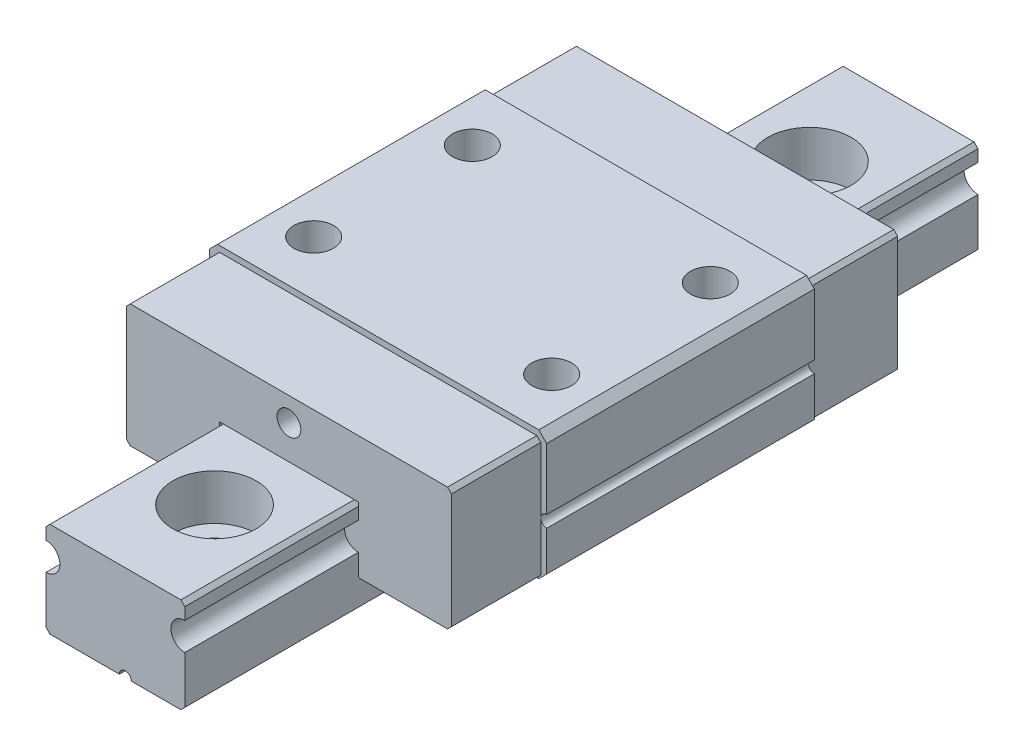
ISO-10303-21;
HEADER;
FILE_DESCRIPTION(('STEP AP214'),'2;1');
FILE_NAME('part.step','',(''),(''),'','','');
FILE_SCHEMA(('AUTOMOTIVE_DESIGN { 1 0 10303 214 1 1 1 1 }'));
ENDSEC;
DATA;
#1=APPLICATION_CONTEXT('core data for automotive mechanical design processes');
#2=APPLICATION_PROTOCOL_DEFINITION('international standard','automotive_design',2000,#1);
#3=PRODUCT_CONTEXT('',#1,'mechanical');
#4=PRODUCT('Part','Part','',(#3));
#5=PRODUCT_RELATED_PRODUCT_CATEGORY('part','',(#4));
#6=PRODUCT_DEFINITION_FORMATION('','',#4);
#7=PRODUCT_DEFINITION_CONTEXT('part definition',#1,'design');
#8=PRODUCT_DEFINITION('design','',#6,#7);
#9=PRODUCT_DEFINITION_SHAPE('','',#8);
#10=(LENGTH_UNIT() NAMED_UNIT(*) SI_UNIT(.MILLI.,.METRE.));
#11=(NAMED_UNIT(*) PLANE_ANGLE_UNIT() SI_UNIT($,.RADIAN.));
#12=(NAMED_UNIT(*) SI_UNIT($,.STERADIAN.) SOLID_ANGLE_UNIT());
#13=UNCERTAINTY_MEASURE_WITH_UNIT(LENGTH_MEASURE(1.E-05),#10,'distance_accuracy_value','');
#14=(GEOMETRIC_REPRESENTATION_CONTEXT(3) GLOBAL_UNCERTAINTY_ASSIGNED_CONTEXT((#13)) GLOBAL_UNIT_ASSIGNED_CONTEXT((#10,
#11,#12)) REPRESENTATION_CONTEXT('',''));
#15=CARTESIAN_POINT('',(0.,0.,0.));
#16=DIRECTION('',(0.,0.,1.));
#17=DIRECTION('',(1.,0.,0.));
#18=AXIS2_PLACEMENT_3D('',#15,#16,#17);
#19=CARTESIAN_POINT('',(3.5,3.3,20.));
#20=DIRECTION('',(0.,0.,-1.));
#21=DIRECTION('',(-1.,0.,0.));
#22=AXIS2_PLACEMENT_3D('',#19,#20,#21);
#23=CYLINDRICAL_SURFACE('',#22,0.7);
#24=DIRECTION('',(0.,0.,1.));
#25=VECTOR('',#24,1.);
#26=CARTESIAN_POINT('',(3.5,4.,20.));
#27=LINE('',#26,#25);
#28=CARTESIAN_POINT('',(3.5,4.,-11.25));
#29=VERTEX_POINT('',#28);
#30=CARTESIAN_POINT('',(3.5,4.,11.25));
#31=VERTEX_POINT('',#30);
#32=EDGE_CURVE('P0_E222',#29,#31,#27,.T.);
#33=ORIENTED_EDGE('',*,*,#32,.F.);
#34=CARTESIAN_POINT('',(3.5,3.3,-11.25));
#35=DIRECTION('',(0.,0.,-1.));
#36=DIRECTION('',(-1.,0.,0.));
#37=AXIS2_PLACEMENT_3D('',#34,#35,#36);
#38=CIRCLE('',#37,0.7);
#39=CARTESIAN_POINT('',(3.5,2.6,-11.25));
#40=VERTEX_POINT('',#39);
#41=EDGE_CURVE('P0_E228',#29,#40,#38,.F.);
#42=ORIENTED_EDGE('',*,*,#41,.T.);
#43=DIRECTION('',(0.,0.,1.));
#44=VECTOR('',#43,1.);
#45=CARTESIAN_POINT('',(3.5,2.6,20.));
#46=LINE('',#45,#44);
#47=CARTESIAN_POINT('',(3.5,2.6,11.25));
#48=VERTEX_POINT('',#47);
#49=EDGE_CURVE('P0_E225',#48,#40,#46,.F.);
#50=ORIENTED_EDGE('',*,*,#49,.F.);
#51=CARTESIAN_POINT('',(3.5,3.3,11.25));
#52=DIRECTION('',(0.,0.,-1.));
#53=DIRECTION('',(-1.,0.,0.));
#54=AXIS2_PLACEMENT_3D('',#51,#52,#53);
#55=CIRCLE('',#54,0.7);
#56=EDGE_CURVE('P0_E19',#48,#31,#55,.T.);
#57=ORIENTED_EDGE('',*,*,#56,.T.);
#58=EDGE_LOOP('',(#33,#42,#50,#57));
#59=FACE_BOUND('',#58,.T.);
#60=ADVANCED_FACE('P0_F16',(#59),#23,.T.);
#61=CARTESIAN_POINT('',(-3.5,3.3,20.));
#62=DIRECTION('',(0.,0.,-1.));
#63=DIRECTION('',(-1.,0.,0.));
#64=AXIS2_PLACEMENT_3D('',#61,#62,#63);
#65=CYLINDRICAL_SURFACE('',#64,0.7);
#66=DIRECTION('',(0.,0.,-1.));
#67=VECTOR('',#66,1.);
#68=CARTESIAN_POINT('',(-3.5,2.6,20.));
#69=LINE('',#68,#67);
#70=CARTESIAN_POINT('',(-3.5,2.6,-11.25));
#71=VERTEX_POINT('',#70);
#72=CARTESIAN_POINT('',(-3.5,2.6,11.25));
#73=VERTEX_POINT('',#72);
#74=EDGE_CURVE('P0_E472',#71,#73,#69,.F.);
#75=ORIENTED_EDGE('',*,*,#74,.F.);
#76=CARTESIAN_POINT('',(-3.5,3.3,-11.25));
#77=DIRECTION('',(0.,0.,-1.));
#78=DIRECTION('',(-1.,0.,0.));
#79=AXIS2_PLACEMENT_3D('',#76,#77,#78);
#80=CIRCLE('',#79,0.7);
#81=CARTESIAN_POINT('',(-3.5,4.,-11.25));
#82=VERTEX_POINT('',#81);
#83=EDGE_CURVE('P0_E240',#71,#82,#80,.F.);
#84=ORIENTED_EDGE('',*,*,#83,.T.);
#85=DIRECTION('',(0.,0.,-1.));
#86=VECTOR('',#85,1.);
#87=CARTESIAN_POINT('',(-3.5,4.,20.));
#88=LINE('',#87,#86);
#89=CARTESIAN_POINT('',(-3.5,4.,11.25));
#90=VERTEX_POINT('',#89);
#91=EDGE_CURVE('P0_E327',#90,#82,#88,.T.);
#92=ORIENTED_EDGE('',*,*,#91,.F.);
#93=CARTESIAN_POINT('',(-3.5,3.3,11.25));
#94=DIRECTION('',(0.,0.,-1.));
#95=DIRECTION('',(-1.,0.,0.));
#96=AXIS2_PLACEMENT_3D('',#93,#94,#95);
#97=CIRCLE('',#96,0.7);
#98=EDGE_CURVE('P0_E242',#90,#73,#97,.T.);
#99=ORIENTED_EDGE('',*,*,#98,.T.);
#100=EDGE_LOOP('',(#75,#84,#92,#99));
#101=FACE_BOUND('',#100,.T.);
#102=ADVANCED_FACE('P0_F1130',(#101),#65,.T.);
#103=CARTESIAN_POINT('',(0.,6.5,6.24999999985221));
#104=DIRECTION('',(0.,0.,1.));
#105=DIRECTION('',(1.,0.,0.));
#106=AXIS2_PLACEMENT_3D('',#103,#104,#105);
#107=CONICAL_SURFACE('',#106,0.599999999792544,1.02974425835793);
#108=CARTESIAN_POINT('',(-5.6843418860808E-11,6.5,5.88948362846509));
#109=VERTEX_POINT('',#108);
#110=VERTEX_LOOP('',#109);
#111=FACE_BOUND('',#110,.T.);
#112=CARTESIAN_POINT('',(0.,6.5,6.25));
#113=DIRECTION('',(0.,0.,-1.));
#114=DIRECTION('',(-1.,0.,0.));
#115=AXIS2_PLACEMENT_3D('',#112,#113,#114);
#116=CIRCLE('',#115,0.6);
#117=CARTESIAN_POINT('',(-0.6,6.5,6.25));
#118=VERTEX_POINT('',#117);
#119=EDGE_CURVE('P0_E427',#118,#118,#116,.F.);
#120=ORIENTED_EDGE('',*,*,#119,.T.);
#121=EDGE_LOOP('',(#120));
#122=FACE_BOUND('',#121,.T.);
#123=ADVANCED_FACE('P0_F1123',(#111,#122),#107,.F.);
#124=CARTESIAN_POINT('',(3.5,4.,20.));
#125=DIRECTION('',(-1.,0.,0.));
#126=DIRECTION('',(0.,0.,1.));
#127=AXIS2_PLACEMENT_3D('',#124,#125,#126);
#128=PLANE('',#127);
#129=DIRECTION('',(0.,0.,-1.));
#130=VECTOR('',#129,1.);
#131=CARTESIAN_POINT('',(3.5,4.8,20.));
#132=LINE('',#131,#130);
#133=CARTESIAN_POINT('',(3.5,4.8,-11.25));
#134=VERTEX_POINT('',#133);
#135=CARTESIAN_POINT('',(3.5,4.8,11.25));
#136=VERTEX_POINT('',#135);
#137=EDGE_CURVE('P0_E252',#134,#136,#132,.F.);
#138=ORIENTED_EDGE('',*,*,#137,.F.);
#139=DIRECTION('',(0.,1.,0.));
#140=VECTOR('',#139,1.);
#141=CARTESIAN_POINT('',(3.5,4.,-11.25));
#142=LINE('',#141,#140);
#143=EDGE_CURVE('P0_E237',#134,#29,#142,.F.);
#144=ORIENTED_EDGE('',*,*,#143,.T.);
#145=ORIENTED_EDGE('',*,*,#32,.T.);
#146=DIRECTION('',(0.,1.,0.));
#147=VECTOR('',#146,1.);
#148=CARTESIAN_POINT('',(3.5,4.,11.25));
#149=LINE('',#148,#147);
#150=EDGE_CURVE('P0_E230',#31,#136,#149,.T.);
#151=ORIENTED_EDGE('',*,*,#150,.T.);
#152=EDGE_LOOP('',(#138,#144,#145,#151));
#153=FACE_BOUND('',#152,.T.);
#154=ADVANCED_FACE('P0_F239',(#153),#128,.T.);
#155=CARTESIAN_POINT('',(-3.5,4.8,20.));
#156=DIRECTION('',(1.,0.,0.));
#157=DIRECTION('',(0.,0.,-1.));
#158=AXIS2_PLACEMENT_3D('',#155,#156,#157);
#159=PLANE('',#158);
#160=ORIENTED_EDGE('',*,*,#91,.T.);
#161=DIRECTION('',(0.,1.,0.));
#162=VECTOR('',#161,1.);
#163=CARTESIAN_POINT('',(-3.5,4.8,-11.25));
#164=LINE('',#163,#162);
#165=CARTESIAN_POINT('',(-3.5,4.8,-11.25));
#166=VERTEX_POINT('',#165);
#167=EDGE_CURVE('P0_E321',#82,#166,#164,.T.);
#168=ORIENTED_EDGE('',*,*,#167,.T.);
#169=DIRECTION('',(0.,0.,-1.));
#170=VECTOR('',#169,1.);
#171=CARTESIAN_POINT('',(-3.5,4.8,20.));
#172=LINE('',#171,#170);
#173=CARTESIAN_POINT('',(-3.5,4.8,11.25));
#174=VERTEX_POINT('',#173);
#175=EDGE_CURVE('P0_E254',#174,#166,#172,.T.);
#176=ORIENTED_EDGE('',*,*,#175,.F.);
#177=DIRECTION('',(0.,1.,0.));
#178=VECTOR('',#177,1.);
#179=CARTESIAN_POINT('',(-3.5,4.8,11.25));
#180=LINE('',#179,#178);
#181=EDGE_CURVE('P0_E249',#174,#90,#180,.F.);
#182=ORIENTED_EDGE('',*,*,#181,.T.);
#183=EDGE_LOOP('',(#160,#168,#176,#182));
#184=FACE_BOUND('',#183,.T.);
#185=ADVANCED_FACE('P0_F1109',(#184),#159,.T.);
#186=CARTESIAN_POINT('',(3.5,0.,20.));
#187=DIRECTION('',(-1.,0.,0.));
#188=DIRECTION('',(0.,0.,1.));
#189=AXIS2_PLACEMENT_3D('',#186,#187,#188);
#190=PLANE('',#189);
#191=ORIENTED_EDGE('',*,*,#49,.T.);
#192=DIRECTION('',(0.,1.,0.));
#193=VECTOR('',#192,1.);
#194=CARTESIAN_POINT('',(3.5,0.,-11.25));
#195=LINE('',#194,#193);
#196=CARTESIAN_POINT('',(3.5,1.5,-11.25));
#197=VERTEX_POINT('',#196);
#198=EDGE_CURVE('P0_E308',#40,#197,#195,.F.);
#199=ORIENTED_EDGE('',*,*,#198,.T.);
#200=DIRECTION('',(0.,0.,-1.));
#201=VECTOR('',#200,1.);
#202=CARTESIAN_POINT('',(3.5,1.5,11.25));
#203=LINE('',#202,#201);
#204=CARTESIAN_POINT('',(3.5,1.5,11.25));
#205=VERTEX_POINT('',#204);
#206=EDGE_CURVE('P0_E335',#205,#197,#203,.T.);
#207=ORIENTED_EDGE('',*,*,#206,.F.);
#208=DIRECTION('',(0.,1.,0.));
#209=VECTOR('',#208,1.);
#210=CARTESIAN_POINT('',(3.5,0.,11.25));
#211=LINE('',#210,#209);
#212=EDGE_CURVE('P0_E319',#205,#48,#211,.T.);
#213=ORIENTED_EDGE('',*,*,#212,.T.);
#214=EDGE_LOOP('',(#191,#199,#207,#213));
#215=FACE_BOUND('',#214,.T.);
#216=ADVANCED_FACE('P0_F318',(#215),#190,.T.);
#217=CARTESIAN_POINT('',(8.5,1.9,6.75));
#218=DIRECTION('',(-0.707106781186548,0.707106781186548,0.));
#219=DIRECTION('',(-0.707106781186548,-0.707106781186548,0.));
#220=AXIS2_PLACEMENT_3D('',#217,#218,#219);
#221=PLANE('',#220);
#222=DIRECTION('',(0.,0.,-1.));
#223=VECTOR('',#222,1.);
#224=CARTESIAN_POINT('',(8.5,1.9,11.25));
#225=LINE('',#224,#223);
#226=CARTESIAN_POINT('',(8.5,1.9,6.75));
#227=VERTEX_POINT('',#226);
#228=CARTESIAN_POINT('',(8.5,1.9,-6.75));
#229=VERTEX_POINT('',#228);
#230=EDGE_CURVE('P0_E255',#227,#229,#225,.T.);
#231=ORIENTED_EDGE('',*,*,#230,.F.);
#232=DIRECTION('',(-0.707106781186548,-0.707106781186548,0.));
#233=VECTOR('',#232,1.);
#234=CARTESIAN_POINT('',(8.5,1.9,6.75));
#235=LINE('',#234,#233);
#236=CARTESIAN_POINT('',(8.1,1.5,6.75));
#237=VERTEX_POINT('',#236);
#238=EDGE_CURVE('P0_E316',#237,#227,#235,.F.);
#239=ORIENTED_EDGE('',*,*,#238,.F.);
#240=DIRECTION('',(0.,0.,-1.));
#241=VECTOR('',#240,1.);
#242=CARTESIAN_POINT('',(8.1,1.5,11.25));
#243=LINE('',#242,#241);
#244=CARTESIAN_POINT('',(8.1,1.5,-6.75));
#245=VERTEX_POINT('',#244);
#246=EDGE_CURVE('P0_E432',#245,#237,#243,.F.);
#247=ORIENTED_EDGE('',*,*,#246,.F.);
#248=DIRECTION('',(-0.707106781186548,-0.707106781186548,0.));
#249=VECTOR('',#248,1.);
#250=CARTESIAN_POINT('',(8.5,1.9,-6.75000000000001));
#251=LINE('',#250,#249);
#252=EDGE_CURVE('P0_E470',#229,#245,#251,.T.);
#253=ORIENTED_EDGE('',*,*,#252,.F.);
#254=EDGE_LOOP('',(#231,#239,#247,#253));
#255=FACE_BOUND('',#254,.T.);
#256=ADVANCED_FACE('P0_F1094',(#255),#221,.F.);
#257=CARTESIAN_POINT('',(0.,6.5,-6.24999999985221));
#258=DIRECTION('',(0.,0.,-1.));
#259=DIRECTION('',(-1.,0.,0.));
#260=AXIS2_PLACEMENT_3D('',#257,#258,#259);
#261=CONICAL_SURFACE('',#260,0.599999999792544,1.02974425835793);
#262=CARTESIAN_POINT('',(-2.8421709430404E-11,6.5,-5.88948362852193));
#263=VERTEX_POINT('',#262);
#264=VERTEX_LOOP('',#263);
#265=FACE_BOUND('',#264,.T.);
#266=CARTESIAN_POINT('',(0.,6.5,-6.25));
#267=DIRECTION('',(0.,0.,1.));
#268=DIRECTION('',(1.,0.,0.));
#269=AXIS2_PLACEMENT_3D('',#266,#267,#268);
#270=CIRCLE('',#269,0.6);
#271=CARTESIAN_POINT('',(0.6,6.5,-6.25));
#272=VERTEX_POINT('',#271);
#273=EDGE_CURVE('P0_E387',#272,#272,#270,.F.);
#274=ORIENTED_EDGE('',*,*,#273,.T.);
#275=EDGE_LOOP('',(#274));
#276=FACE_BOUND('',#275,.T.);
#277=ADVANCED_FACE('P0_F1086',(#265,#276),#261,.F.);
#278=CARTESIAN_POINT('',(-3.5,2.6,20.));
#279=DIRECTION('',(1.,0.,0.));
#280=DIRECTION('',(0.,0.,-1.));
#281=AXIS2_PLACEMENT_3D('',#278,#279,#280);
#282=PLANE('',#281);
#283=DIRECTION('',(0.,0.,-1.));
#284=VECTOR('',#283,1.);
#285=CARTESIAN_POINT('',(-3.5,1.5,11.25));
#286=LINE('',#285,#284);
#287=CARTESIAN_POINT('',(-3.5,1.5,-11.25));
#288=VERTEX_POINT('',#287);
#289=CARTESIAN_POINT('',(-3.5,1.5,11.25));
#290=VERTEX_POINT('',#289);
#291=EDGE_CURVE('P0_E383',#288,#290,#286,.F.);
#292=ORIENTED_EDGE('',*,*,#291,.F.);
#293=DIRECTION('',(0.,1.,0.));
#294=VECTOR('',#293,1.);
#295=CARTESIAN_POINT('',(-3.5,2.6,-11.25));
#296=LINE('',#295,#294);
#297=EDGE_CURVE('P0_E484',#288,#71,#296,.T.);
#298=ORIENTED_EDGE('',*,*,#297,.T.);
#299=ORIENTED_EDGE('',*,*,#74,.T.);
#300=DIRECTION('',(0.,1.,0.));
#301=VECTOR('',#300,1.);
#302=CARTESIAN_POINT('',(-3.5,2.6,11.25));
#303=LINE('',#302,#301);
#304=EDGE_CURVE('P0_E487',#73,#290,#303,.F.);
#305=ORIENTED_EDGE('',*,*,#304,.T.);
#306=EDGE_LOOP('',(#292,#298,#299,#305));
#307=FACE_BOUND('',#306,.T.);
#308=ADVANCED_FACE('P0_F1078',(#307),#282,.T.);
#309=CARTESIAN_POINT('',(0.,6.5,11.25));
#310=DIRECTION('',(0.,0.,-1.));
#311=DIRECTION('',(-1.,0.,0.));
#312=AXIS2_PLACEMENT_3D('',#309,#310,#311);
#313=CYLINDRICAL_SURFACE('',#312,0.6);
#314=CARTESIAN_POINT('',(0.,6.5,11.25));
#315=DIRECTION('',(0.,0.,-1.));
#316=DIRECTION('',(-1.,0.,0.));
#317=AXIS2_PLACEMENT_3D('',#314,#315,#316);
#318=CIRCLE('',#317,0.6);
#319=CARTESIAN_POINT('',(-0.6,6.5,11.25));
#320=VERTEX_POINT('',#319);
#321=EDGE_CURVE('P0_E300',#320,#320,#318,.T.);
#322=ORIENTED_EDGE('',*,*,#321,.F.);
#323=EDGE_LOOP('',(#322));
#324=FACE_BOUND('',#323,.T.);
#325=ORIENTED_EDGE('',*,*,#119,.F.);
#326=EDGE_LOOP('',(#325));
#327=FACE_BOUND('',#326,.T.);
#328=ADVANCED_FACE('P0_F1070',(#324,#327),#313,.F.);
#329=CARTESIAN_POINT('',(8.5,3.9,11.25));
#330=DIRECTION('',(1.,0.,0.));
#331=DIRECTION('',(0.,0.,-1.));
#332=AXIS2_PLACEMENT_3D('',#329,#330,#331);
#333=PLANE('',#332);
#334=DIRECTION('',(0.,1.,0.));
#335=VECTOR('',#334,1.);
#336=CARTESIAN_POINT('',(8.5,1.5,6.75));
#337=LINE('',#336,#335);
#338=CARTESIAN_POINT('',(8.5,3.9,6.75));
#339=VERTEX_POINT('',#338);
#340=EDGE_CURVE('P0_E367',#227,#339,#337,.T.);
#341=ORIENTED_EDGE('',*,*,#340,.F.);
#342=ORIENTED_EDGE('',*,*,#230,.T.);
#343=DIRECTION('',(0.,1.,0.));
#344=VECTOR('',#343,1.);
#345=CARTESIAN_POINT('',(8.5,1.5,-6.75));
#346=LINE('',#345,#344);
#347=CARTESIAN_POINT('',(8.5,3.9,-6.75));
#348=VERTEX_POINT('',#347);
#349=EDGE_CURVE('P0_E291',#348,#229,#346,.F.);
#350=ORIENTED_EDGE('',*,*,#349,.F.);
#351=DIRECTION('',(0.,0.,-1.));
#352=VECTOR('',#351,1.);
#353=CARTESIAN_POINT('',(8.5,3.9,11.25));
#354=LINE('',#353,#352);
#355=EDGE_CURVE('P0_E299',#348,#339,#354,.F.);
#356=ORIENTED_EDGE('',*,*,#355,.T.);
#357=EDGE_LOOP('',(#341,#342,#350,#356));
#358=FACE_BOUND('',#357,.T.);
#359=ADVANCED_FACE('P0_F1062',(#358),#333,.T.);
#360=CARTESIAN_POINT('',(3.5,4.8,20.));
#361=DIRECTION('',(0.,-1.,0.));
#362=DIRECTION('',(0.,0.,-1.));
#363=AXIS2_PLACEMENT_3D('',#360,#361,#362);
#364=PLANE('',#363);
#365=ORIENTED_EDGE('',*,*,#175,.T.);
#366=DIRECTION('',(1.,0.,0.));
#367=VECTOR('',#366,1.);
#368=CARTESIAN_POINT('',(8.5,4.8,-11.25));
#369=LINE('',#368,#367);
#370=EDGE_CURVE('P0_E338',#166,#134,#369,.T.);
#371=ORIENTED_EDGE('',*,*,#370,.T.);
#372=ORIENTED_EDGE('',*,*,#137,.T.);
#373=DIRECTION('',(1.,0.,0.));
#374=VECTOR('',#373,1.);
#375=CARTESIAN_POINT('',(8.5,4.8,11.25));
#376=LINE('',#375,#374);
#377=EDGE_CURVE('P0_E233',#174,#136,#376,.T.);
#378=ORIENTED_EDGE('',*,*,#377,.F.);
#379=EDGE_LOOP('',(#365,#371,#372,#378));
#380=FACE_BOUND('',#379,.T.);
#381=ADVANCED_FACE('P0_F1054',(#380),#364,.T.);
#382=CARTESIAN_POINT('',(8.5,1.5,11.25));
#383=DIRECTION('',(0.,-1.,0.));
#384=DIRECTION('',(0.,0.,-1.));
#385=AXIS2_PLACEMENT_3D('',#382,#383,#384);
#386=PLANE('',#385);
#387=DIRECTION('',(-1.,0.,0.));
#388=VECTOR('',#387,1.);
#389=CARTESIAN_POINT('',(-8.2,1.5,-6.75));
#390=LINE('',#389,#388);
#391=CARTESIAN_POINT('',(8.,1.5,-6.75000000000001));
#392=VERTEX_POINT('',#391);
#393=EDGE_CURVE('P0_E292',#245,#392,#390,.T.);
#394=ORIENTED_EDGE('',*,*,#393,.F.);
#395=ORIENTED_EDGE('',*,*,#246,.T.);
#396=DIRECTION('',(1.,0.,0.));
#397=VECTOR('',#396,1.);
#398=CARTESIAN_POINT('',(-8.2,1.5,6.75));
#399=LINE('',#398,#397);
#400=CARTESIAN_POINT('',(8.,1.5,6.75));
#401=VERTEX_POINT('',#400);
#402=EDGE_CURVE('P0_E359',#401,#237,#399,.T.);
#403=ORIENTED_EDGE('',*,*,#402,.F.);
#404=DIRECTION('',(0.,0.,1.));
#405=VECTOR('',#404,1.);
#406=CARTESIAN_POINT('',(8.,1.5,11.25));
#407=LINE('',#406,#405);
#408=CARTESIAN_POINT('',(8.,1.5,11.25));
#409=VERTEX_POINT('',#408);
#410=EDGE_CURVE('P0_E353',#409,#401,#407,.F.);
#411=ORIENTED_EDGE('',*,*,#410,.F.);
#412=DIRECTION('',(1.,0.,0.));
#413=VECTOR('',#412,1.);
#414=CARTESIAN_POINT('',(8.5,1.5,11.25));
#415=LINE('',#414,#413);
#416=EDGE_CURVE('P0_E347',#205,#409,#415,.T.);
#417=ORIENTED_EDGE('',*,*,#416,.F.);
#418=ORIENTED_EDGE('',*,*,#206,.T.);
#419=DIRECTION('',(1.,0.,0.));
#420=VECTOR('',#419,1.);
#421=CARTESIAN_POINT('',(8.5,1.5,-11.25));
#422=LINE('',#421,#420);
#423=CARTESIAN_POINT('',(8.,1.5,-11.25));
#424=VERTEX_POINT('',#423);
#425=EDGE_CURVE('P0_E312',#197,#424,#422,.T.);
#426=ORIENTED_EDGE('',*,*,#425,.T.);
#427=DIRECTION('',(0.,0.,1.));
#428=VECTOR('',#427,1.);
#429=CARTESIAN_POINT('',(8.,1.5,11.25));
#430=LINE('',#429,#428);
#431=EDGE_CURVE('P0_E411',#424,#392,#430,.T.);
#432=ORIENTED_EDGE('',*,*,#431,.T.);
#433=EDGE_LOOP('',(#394,#395,#403,#411,#417,#418,#426,#432));
#434=FACE_BOUND('',#433,.T.);
#435=ADVANCED_FACE('P0_F1046',(#434),#386,.T.);
#436=CARTESIAN_POINT('',(0.,6.5,-11.25));
#437=DIRECTION('',(0.,0.,1.));
#438=DIRECTION('',(1.,0.,0.));
#439=AXIS2_PLACEMENT_3D('',#436,#437,#438);
#440=CYLINDRICAL_SURFACE('',#439,0.6);
#441=CARTESIAN_POINT('',(0.,6.5,-11.25));
#442=DIRECTION('',(0.,0.,1.));
#443=DIRECTION('',(1.,0.,0.));
#444=AXIS2_PLACEMENT_3D('',#441,#442,#443);
#445=CIRCLE('',#444,0.6);
#446=CARTESIAN_POINT('',(0.6,6.5,-11.25));
#447=VERTEX_POINT('',#446);
#448=EDGE_CURVE('P0_E283',#447,#447,#445,.F.);
#449=ORIENTED_EDGE('',*,*,#448,.T.);
#450=EDGE_LOOP('',(#449));
#451=FACE_BOUND('',#450,.T.);
#452=ORIENTED_EDGE('',*,*,#273,.F.);
#453=EDGE_LOOP('',(#452));
#454=FACE_BOUND('',#453,.T.);
#455=ADVANCED_FACE('P0_F1039',(#451,#454),#440,.F.);
#456=CARTESIAN_POINT('',(8.5,1.5,11.25));
#457=DIRECTION('',(0.,-1.,0.));
#458=DIRECTION('',(0.,0.,-1.));
#459=AXIS2_PLACEMENT_3D('',#456,#457,#458);
#460=PLANE('',#459);
#461=DIRECTION('',(1.,0.,0.));
#462=VECTOR('',#461,1.);
#463=CARTESIAN_POINT('',(8.5,1.5,6.75));
#464=LINE('',#463,#462);
#465=CARTESIAN_POINT('',(-8.,1.5,6.75));
#466=VERTEX_POINT('',#465);
#467=CARTESIAN_POINT('',(-8.1,1.5,6.75));
#468=VERTEX_POINT('',#467);
#469=EDGE_CURVE('P0_E381',#466,#468,#464,.F.);
#470=ORIENTED_EDGE('',*,*,#469,.T.);
#471=DIRECTION('',(0.,0.,1.));
#472=VECTOR('',#471,1.);
#473=CARTESIAN_POINT('',(-8.1,1.5,6.75));
#474=LINE('',#473,#472);
#475=CARTESIAN_POINT('',(-8.1,1.5,-6.75));
#476=VERTEX_POINT('',#475);
#477=EDGE_CURVE('P0_E286',#468,#476,#474,.F.);
#478=ORIENTED_EDGE('',*,*,#477,.T.);
#479=DIRECTION('',(1.,0.,0.));
#480=VECTOR('',#479,1.);
#481=CARTESIAN_POINT('',(8.5,1.5,-6.75));
#482=LINE('',#481,#480);
#483=CARTESIAN_POINT('',(-8.,1.5,-6.75));
#484=VERTEX_POINT('',#483);
#485=EDGE_CURVE('P0_E384',#476,#484,#482,.T.);
#486=ORIENTED_EDGE('',*,*,#485,.T.);
#487=DIRECTION('',(0.,0.,1.));
#488=VECTOR('',#487,1.);
#489=CARTESIAN_POINT('',(-7.99999999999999,1.50000000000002,-11.25));
#490=LINE('',#489,#488);
#491=CARTESIAN_POINT('',(-7.99999999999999,1.50000000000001,-11.25));
#492=VERTEX_POINT('',#491);
#493=EDGE_CURVE('P0_E563',#484,#492,#490,.F.);
#494=ORIENTED_EDGE('',*,*,#493,.T.);
#495=DIRECTION('',(1.,0.,0.));
#496=VECTOR('',#495,1.);
#497=CARTESIAN_POINT('',(8.5,1.5,-11.25));
#498=LINE('',#497,#496);
#499=EDGE_CURVE('P0_E287',#492,#288,#498,.T.);
#500=ORIENTED_EDGE('',*,*,#499,.T.);
#501=ORIENTED_EDGE('',*,*,#291,.T.);
#502=DIRECTION('',(1.,0.,0.));
#503=VECTOR('',#502,1.);
#504=CARTESIAN_POINT('',(8.5,1.5,11.25));
#505=LINE('',#504,#503);
#506=CARTESIAN_POINT('',(-8.,1.5,11.25));
#507=VERTEX_POINT('',#506);
#508=EDGE_CURVE('P0_E303',#507,#290,#505,.T.);
#509=ORIENTED_EDGE('',*,*,#508,.F.);
#510=DIRECTION('',(0.,0.,1.));
#511=VECTOR('',#510,1.);
#512=CARTESIAN_POINT('',(-8.,1.5,11.25));
#513=LINE('',#512,#511);
#514=EDGE_CURVE('P0_E378',#507,#466,#513,.F.);
#515=ORIENTED_EDGE('',*,*,#514,.T.);
#516=EDGE_LOOP('',(#470,#478,#486,#494,#500,#501,#509,#515));
#517=FACE_BOUND('',#516,.T.);
#518=ADVANCED_FACE('P0_F775',(#517),#460,.T.);
#519=CARTESIAN_POINT('',(-8.,1.5,11.25));
#520=DIRECTION('',(0.707106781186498,0.707106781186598,0.));
#521=DIRECTION('',(-0.707106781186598,0.707106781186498,0.));
#522=AXIS2_PLACEMENT_3D('',#519,#520,#521);
#523=PLANE('',#522);
#524=DIRECTION('',(-0.707106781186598,0.707106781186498,0.));
#525=VECTOR('',#524,1.);
#526=CARTESIAN_POINT('',(-8.,1.5,6.75));
#527=LINE('',#526,#525);
#528=CARTESIAN_POINT('',(-8.20000000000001,1.69999999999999,6.75));
#529=VERTEX_POINT('',#528);
#530=EDGE_CURVE('P0_E375',#466,#529,#527,.T.);
#531=ORIENTED_EDGE('',*,*,#530,.F.);
#532=ORIENTED_EDGE('',*,*,#514,.F.);
#533=DIRECTION('',(0.707106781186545,-0.70710678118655,0.));
#534=VECTOR('',#533,1.);
#535=CARTESIAN_POINT('',(-8.2,1.7,11.25));
#536=LINE('',#535,#534);
#537=CARTESIAN_POINT('',(-8.20000000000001,1.69999999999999,11.25));
#538=VERTEX_POINT('',#537);
#539=EDGE_CURVE('P0_E504',#538,#507,#536,.T.);
#540=ORIENTED_EDGE('',*,*,#539,.F.);
#541=DIRECTION('',(0.,0.,1.));
#542=VECTOR('',#541,1.);
#543=CARTESIAN_POINT('',(-8.2,1.7,11.25));
#544=LINE('',#543,#542);
#545=EDGE_CURVE('P0_E542',#529,#538,#544,.T.);
#546=ORIENTED_EDGE('',*,*,#545,.F.);
#547=EDGE_LOOP('',(#531,#532,#540,#546));
#548=FACE_BOUND('',#547,.T.);
#549=ADVANCED_FACE('P0_F780',(#548),#523,.F.);
#550=CARTESIAN_POINT('',(-8.2,7.5,11.25));
#551=DIRECTION('',(0.707106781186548,-0.707106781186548,0.));
#552=DIRECTION('',(0.707106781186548,0.707106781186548,0.));
#553=AXIS2_PLACEMENT_3D('',#550,#551,#552);
#554=PLANE('',#553);
#555=DIRECTION('',(0.707106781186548,0.707106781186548,0.));
#556=VECTOR('',#555,1.);
#557=CARTESIAN_POINT('',(-8.2,7.5,6.75));
#558=LINE('',#557,#556);
#559=CARTESIAN_POINT('',(-8.2,7.5,6.75));
#560=VERTEX_POINT('',#559);
#561=CARTESIAN_POINT('',(-8.,7.7,6.75));
#562=VERTEX_POINT('',#561);
#563=EDGE_CURVE('P0_E370',#560,#562,#558,.T.);
#564=ORIENTED_EDGE('',*,*,#563,.F.);
#565=DIRECTION('',(0.,0.,1.));
#566=VECTOR('',#565,1.);
#567=CARTESIAN_POINT('',(-8.2,7.5,11.25));
#568=LINE('',#567,#566);
#569=CARTESIAN_POINT('',(-8.2,7.5,11.25));
#570=VERTEX_POINT('',#569);
#571=EDGE_CURVE('P0_E545',#570,#560,#568,.F.);
#572=ORIENTED_EDGE('',*,*,#571,.F.);
#573=DIRECTION('',(-0.707106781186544,-0.707106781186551,0.));
#574=VECTOR('',#573,1.);
#575=CARTESIAN_POINT('',(-8.,7.7,11.25));
#576=LINE('',#575,#574);
#577=CARTESIAN_POINT('',(-8.,7.7,11.25));
#578=VERTEX_POINT('',#577);
#579=EDGE_CURVE('P0_E508',#578,#570,#576,.T.);
#580=ORIENTED_EDGE('',*,*,#579,.F.);
#581=DIRECTION('',(0.,0.,1.));
#582=VECTOR('',#581,1.);
#583=CARTESIAN_POINT('',(-8.,7.7,11.25));
#584=LINE('',#583,#582);
#585=EDGE_CURVE('P0_E440',#562,#578,#584,.T.);
#586=ORIENTED_EDGE('',*,*,#585,.F.);
#587=EDGE_LOOP('',(#564,#572,#580,#586));
#588=FACE_BOUND('',#587,.T.);
#589=ADVANCED_FACE('P0_F786',(#588),#554,.F.);
#590=CARTESIAN_POINT('',(-8.2,1.5,6.75));
#591=DIRECTION('',(0.,0.,1.));
#592=DIRECTION('',(1.,0.,0.));
#593=AXIS2_PLACEMENT_3D('',#590,#591,#592);
#594=PLANE('',#593);
#595=ORIENTED_EDGE('',*,*,#402,.T.);
#596=ORIENTED_EDGE('',*,*,#238,.T.);
#597=ORIENTED_EDGE('',*,*,#340,.T.);
#598=CARTESIAN_POINT('',(8.5,4.2,6.75));
#599=DIRECTION('',(0.,0.,-1.));
#600=DIRECTION('',(-1.,0.,0.));
#601=AXIS2_PLACEMENT_3D('',#598,#599,#600);
#602=CIRCLE('',#601,0.3);
#603=CARTESIAN_POINT('',(8.2,4.2,6.75));
#604=VERTEX_POINT('',#603);
#605=EDGE_CURVE('P0_E297',#339,#604,#602,.T.);
#606=ORIENTED_EDGE('',*,*,#605,.T.);
#607=DIRECTION('',(0.,1.,0.));
#608=VECTOR('',#607,1.);
#609=CARTESIAN_POINT('',(8.2,1.5,6.75));
#610=LINE('',#609,#608);
#611=CARTESIAN_POINT('',(8.2,1.7,6.75));
#612=VERTEX_POINT('',#611);
#613=EDGE_CURVE('P0_E447',#604,#612,#610,.F.);
#614=ORIENTED_EDGE('',*,*,#613,.T.);
#615=DIRECTION('',(0.707106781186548,0.707106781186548,0.));
#616=VECTOR('',#615,1.);
#617=CARTESIAN_POINT('',(8.2,1.7,6.75));
#618=LINE('',#617,#616);
#619=EDGE_CURVE('P0_E348',#401,#612,#618,.T.);
#620=ORIENTED_EDGE('',*,*,#619,.F.);
#621=EDGE_LOOP('',(#595,#596,#597,#606,#614,#620));
#622=FACE_BOUND('',#621,.T.);
#623=ADVANCED_FACE('P0_F1014',(#622),#594,.T.);
#624=CARTESIAN_POINT('',(8.2,1.7,11.25));
#625=DIRECTION('',(0.707106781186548,-0.707106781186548,0.));
#626=DIRECTION('',(0.707106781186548,0.707106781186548,0.));
#627=AXIS2_PLACEMENT_3D('',#624,#625,#626);
#628=PLANE('',#627);
#629=DIRECTION('',(0.,0.,1.));
#630=VECTOR('',#629,1.);
#631=CARTESIAN_POINT('',(8.2,1.7,11.25));
#632=LINE('',#631,#630);
#633=CARTESIAN_POINT('',(8.2,1.7,11.25));
#634=VERTEX_POINT('',#633);
#635=EDGE_CURVE('P0_E520',#612,#634,#632,.T.);
#636=ORIENTED_EDGE('',*,*,#635,.T.);
#637=DIRECTION('',(0.707106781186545,0.70710678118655,0.));
#638=VECTOR('',#637,1.);
#639=CARTESIAN_POINT('',(8.,1.5,11.25));
#640=LINE('',#639,#638);
#641=EDGE_CURVE('P0_E350',#409,#634,#640,.T.);
#642=ORIENTED_EDGE('',*,*,#641,.F.);
#643=ORIENTED_EDGE('',*,*,#410,.T.);
#644=ORIENTED_EDGE('',*,*,#619,.T.);
#645=EDGE_LOOP('',(#636,#642,#643,#644));
#646=FACE_BOUND('',#645,.T.);
#647=ADVANCED_FACE('P0_F1006',(#646),#628,.T.);
#648=CARTESIAN_POINT('',(8.5,4.2,11.25));
#649=DIRECTION('',(0.,0.,1.));
#650=DIRECTION('',(1.,0.,0.));
#651=AXIS2_PLACEMENT_3D('',#648,#649,#650);
#652=PLANE('',#651);
#653=ORIENTED_EDGE('',*,*,#321,.T.);
#654=EDGE_LOOP('',(#653));
#655=FACE_BOUND('',#654,.T.);
#656=ORIENTED_EDGE('',*,*,#98,.F.);
#657=ORIENTED_EDGE('',*,*,#181,.F.);
#658=ORIENTED_EDGE('',*,*,#377,.T.);
#659=ORIENTED_EDGE('',*,*,#150,.F.);
#660=ORIENTED_EDGE('',*,*,#56,.F.);
#661=ORIENTED_EDGE('',*,*,#212,.F.);
#662=ORIENTED_EDGE('',*,*,#416,.T.);
#663=ORIENTED_EDGE('',*,*,#641,.T.);
#664=DIRECTION('',(0.,1.,0.));
#665=VECTOR('',#664,1.);
#666=CARTESIAN_POINT('',(8.2,1.5,11.25));
#667=LINE('',#666,#665);
#668=CARTESIAN_POINT('',(8.2,7.5,11.25));
#669=VERTEX_POINT('',#668);
#670=EDGE_CURVE('P0_E521',#634,#669,#667,.T.);
#671=ORIENTED_EDGE('',*,*,#670,.T.);
#672=DIRECTION('',(-0.707106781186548,0.707106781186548,0.));
#673=VECTOR('',#672,1.);
#674=CARTESIAN_POINT('',(8.,7.7,11.25));
#675=LINE('',#674,#673);
#676=CARTESIAN_POINT('',(8.,7.7,11.25));
#677=VERTEX_POINT('',#676);
#678=EDGE_CURVE('P0_E431',#677,#669,#675,.F.);
#679=ORIENTED_EDGE('',*,*,#678,.F.);
#680=DIRECTION('',(1.,0.,0.));
#681=VECTOR('',#680,1.);
#682=CARTESIAN_POINT('',(-8.5,7.7,11.25));
#683=LINE('',#682,#681);
#684=EDGE_CURVE('P0_E444',#578,#677,#683,.T.);
#685=ORIENTED_EDGE('',*,*,#684,.F.);
#686=ORIENTED_EDGE('',*,*,#579,.T.);
#687=DIRECTION('',(0.,1.,0.));
#688=VECTOR('',#687,1.);
#689=CARTESIAN_POINT('',(-8.2,1.5,11.25));
#690=LINE('',#689,#688);
#691=EDGE_CURVE('P0_E441',#538,#570,#690,.T.);
#692=ORIENTED_EDGE('',*,*,#691,.F.);
#693=ORIENTED_EDGE('',*,*,#539,.T.);
#694=ORIENTED_EDGE('',*,*,#508,.T.);
#695=ORIENTED_EDGE('',*,*,#304,.F.);
#696=EDGE_LOOP('',(#656,#657,#658,#659,#660,#661,#662,#663,#671,#679,#685,#686,#692,#693,#694,#695));
#697=FACE_BOUND('',#696,.T.);
#698=ADVANCED_FACE('P0_F231',(#655,#697),#652,.T.);
#699=CARTESIAN_POINT('',(8.,7.7,11.25));
#700=DIRECTION('',(0.707106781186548,0.707106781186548,0.));
#701=DIRECTION('',(-0.707106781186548,0.707106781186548,0.));
#702=AXIS2_PLACEMENT_3D('',#699,#700,#701);
#703=PLANE('',#702);
#704=DIRECTION('',(0.,0.,1.));
#705=VECTOR('',#704,1.);
#706=CARTESIAN_POINT('',(8.,7.7,11.25));
#707=LINE('',#706,#705);
#708=CARTESIAN_POINT('',(8.,7.7,6.75));
#709=VERTEX_POINT('',#708);
#710=EDGE_CURVE('P0_E437',#677,#709,#707,.F.);
#711=ORIENTED_EDGE('',*,*,#710,.F.);
#712=ORIENTED_EDGE('',*,*,#678,.T.);
#713=DIRECTION('',(0.,0.,1.));
#714=VECTOR('',#713,1.);
#715=CARTESIAN_POINT('',(8.2,7.5,11.25));
#716=LINE('',#715,#714);
#717=CARTESIAN_POINT('',(8.2,7.5,6.75));
#718=VERTEX_POINT('',#717);
#719=EDGE_CURVE('P0_E523',#669,#718,#716,.F.);
#720=ORIENTED_EDGE('',*,*,#719,.T.);
#721=DIRECTION('',(-0.707106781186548,0.707106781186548,0.));
#722=VECTOR('',#721,1.);
#723=CARTESIAN_POINT('',(8.,7.7,6.75));
#724=LINE('',#723,#722);
#725=EDGE_CURVE('P0_E302',#718,#709,#724,.T.);
#726=ORIENTED_EDGE('',*,*,#725,.T.);
#727=EDGE_LOOP('',(#711,#712,#720,#726));
#728=FACE_BOUND('',#727,.T.);
#729=ADVANCED_FACE('P0_F600',(#728),#703,.T.);
#730=CARTESIAN_POINT('',(8.5,4.2,11.25));
#731=DIRECTION('',(0.,0.,-1.));
#732=DIRECTION('',(-1.,0.,0.));
#733=AXIS2_PLACEMENT_3D('',#730,#731,#732);
#734=CYLINDRICAL_SURFACE('',#733,0.3);
#735=DIRECTION('',(0.,0.,-1.));
#736=VECTOR('',#735,1.);
#737=CARTESIAN_POINT('',(8.5,4.5,11.25));
#738=LINE('',#737,#736);
#739=CARTESIAN_POINT('',(8.5,4.5,6.75));
#740=VERTEX_POINT('',#739);
#741=CARTESIAN_POINT('',(8.5,4.5,-6.75));
#742=VERTEX_POINT('',#741);
#743=EDGE_CURVE('P0_E535',#740,#742,#738,.T.);
#744=ORIENTED_EDGE('',*,*,#743,.F.);
#745=CARTESIAN_POINT('',(8.5,4.2,6.75));
#746=DIRECTION('',(0.,0.,-1.));
#747=DIRECTION('',(-1.,0.,0.));
#748=AXIS2_PLACEMENT_3D('',#745,#746,#747);
#749=CIRCLE('',#748,0.3);
#750=EDGE_CURVE('P0_E295',#604,#740,#749,.T.);
#751=ORIENTED_EDGE('',*,*,#750,.F.);
#752=ORIENTED_EDGE('',*,*,#605,.F.);
#753=ORIENTED_EDGE('',*,*,#355,.F.);
#754=CARTESIAN_POINT('',(8.5,4.2,-6.75));
#755=DIRECTION('',(0.,0.,-1.));
#756=DIRECTION('',(-1.,0.,0.));
#757=AXIS2_PLACEMENT_3D('',#754,#755,#756);
#758=CIRCLE('',#757,0.3);
#759=CARTESIAN_POINT('',(8.2,4.2,-6.75));
#760=VERTEX_POINT('',#759);
#761=EDGE_CURVE('P0_E288',#760,#348,#758,.F.);
#762=ORIENTED_EDGE('',*,*,#761,.F.);
#763=CARTESIAN_POINT('',(8.5,4.2,-6.75));
#764=DIRECTION('',(0.,0.,-1.));
#765=DIRECTION('',(-1.,0.,0.));
#766=AXIS2_PLACEMENT_3D('',#763,#764,#765);
#767=CIRCLE('',#766,0.3);
#768=EDGE_CURVE('P0_E293',#742,#760,#767,.F.);
#769=ORIENTED_EDGE('',*,*,#768,.F.);
#770=EDGE_LOOP('',(#744,#751,#752,#753,#762,#769));
#771=FACE_BOUND('',#770,.T.);
#772=ADVANCED_FACE('P0_F707',(#771),#734,.F.);
#773=CARTESIAN_POINT('',(-8.2,1.5,-6.75));
#774=DIRECTION('',(0.,0.,-1.));
#775=DIRECTION('',(-1.,0.,0.));
#776=AXIS2_PLACEMENT_3D('',#773,#774,#775);
#777=PLANE('',#776);
#778=ORIENTED_EDGE('',*,*,#349,.T.);
#779=ORIENTED_EDGE('',*,*,#252,.T.);
#780=ORIENTED_EDGE('',*,*,#393,.T.);
#781=DIRECTION('',(-0.707106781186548,-0.707106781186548,0.));
#782=VECTOR('',#781,1.);
#783=CARTESIAN_POINT('',(8.,1.5,-6.75000000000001));
#784=LINE('',#783,#782);
#785=CARTESIAN_POINT('',(8.2,1.7,-6.75));
#786=VERTEX_POINT('',#785);
#787=EDGE_CURVE('P0_E413',#392,#786,#784,.F.);
#788=ORIENTED_EDGE('',*,*,#787,.T.);
#789=DIRECTION('',(0.,1.,0.));
#790=VECTOR('',#789,1.);
#791=CARTESIAN_POINT('',(8.2,1.5,-6.75));
#792=LINE('',#791,#790);
#793=EDGE_CURVE('P0_E575',#760,#786,#792,.F.);
#794=ORIENTED_EDGE('',*,*,#793,.F.);
#795=ORIENTED_EDGE('',*,*,#761,.T.);
#796=EDGE_LOOP('',(#778,#779,#780,#788,#794,#795));
#797=FACE_BOUND('',#796,.T.);
#798=ADVANCED_FACE('P0_F713',(#797),#777,.T.);
#799=CARTESIAN_POINT('',(8.,1.5,11.25));
#800=DIRECTION('',(-0.707106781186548,0.707106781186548,0.));
#801=DIRECTION('',(-0.707106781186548,-0.707106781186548,0.));
#802=AXIS2_PLACEMENT_3D('',#799,#800,#801);
#803=PLANE('',#802);
#804=ORIENTED_EDGE('',*,*,#787,.F.);
#805=ORIENTED_EDGE('',*,*,#431,.F.);
#806=DIRECTION('',(0.707106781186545,0.70710678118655,0.));
#807=VECTOR('',#806,1.);
#808=CARTESIAN_POINT('',(8.,1.5,-11.25));
#809=LINE('',#808,#807);
#810=CARTESIAN_POINT('',(8.2,1.7,-11.25));
#811=VERTEX_POINT('',#810);
#812=EDGE_CURVE('P0_E417',#424,#811,#809,.T.);
#813=ORIENTED_EDGE('',*,*,#812,.T.);
#814=DIRECTION('',(0.,0.,-1.));
#815=VECTOR('',#814,1.);
#816=CARTESIAN_POINT('',(8.2,1.7,-11.25));
#817=LINE('',#816,#815);
#818=EDGE_CURVE('P0_E572',#786,#811,#817,.T.);
#819=ORIENTED_EDGE('',*,*,#818,.F.);
#820=EDGE_LOOP('',(#804,#805,#813,#819));
#821=FACE_BOUND('',#820,.T.);
#822=ADVANCED_FACE('P0_F974',(#821),#803,.F.);
#823=CARTESIAN_POINT('',(8.2,7.5,-11.25));
#824=DIRECTION('',(-0.707106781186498,-0.707106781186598,0.));
#825=DIRECTION('',(0.707106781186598,-0.707106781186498,0.));
#826=AXIS2_PLACEMENT_3D('',#823,#824,#825);
#827=PLANE('',#826);
#828=DIRECTION('',(0.707106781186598,-0.707106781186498,0.));
#829=VECTOR('',#828,1.);
#830=CARTESIAN_POINT('',(8.2,7.5,-6.75));
#831=LINE('',#830,#829);
#832=CARTESIAN_POINT('',(8.2,7.5,-6.75));
#833=VERTEX_POINT('',#832);
#834=CARTESIAN_POINT('',(7.99999999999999,7.69999999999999,-6.75));
#835=VERTEX_POINT('',#834);
#836=EDGE_CURVE('P0_E567',#833,#835,#831,.F.);
#837=ORIENTED_EDGE('',*,*,#836,.F.);
#838=DIRECTION('',(0.,0.,-1.));
#839=VECTOR('',#838,1.);
#840=CARTESIAN_POINT('',(8.2,7.5,-11.25));
#841=LINE('',#840,#839);
#842=CARTESIAN_POINT('',(8.2,7.5,-11.25));
#843=VERTEX_POINT('',#842);
#844=EDGE_CURVE('P0_E646',#843,#833,#841,.F.);
#845=ORIENTED_EDGE('',*,*,#844,.F.);
#846=DIRECTION('',(-0.707106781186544,0.707106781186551,0.));
#847=VECTOR('',#846,1.);
#848=CARTESIAN_POINT('',(8.2,7.5,-11.25));
#849=LINE('',#848,#847);
#850=CARTESIAN_POINT('',(8.,7.7,-11.25));
#851=VERTEX_POINT('',#850);
#852=EDGE_CURVE('P0_E422',#843,#851,#849,.T.);
#853=ORIENTED_EDGE('',*,*,#852,.T.);
#854=DIRECTION('',(0.,0.,1.));
#855=VECTOR('',#854,1.);
#856=CARTESIAN_POINT('',(8.,7.7,-11.25));
#857=LINE('',#856,#855);
#858=EDGE_CURVE('P0_E392',#835,#851,#857,.F.);
#859=ORIENTED_EDGE('',*,*,#858,.F.);
#860=EDGE_LOOP('',(#837,#845,#853,#859));
#861=FACE_BOUND('',#860,.T.);
#862=ADVANCED_FACE('P0_F721',(#861),#827,.F.);
#863=CARTESIAN_POINT('',(-8.2,1.7,-11.25));
#864=DIRECTION('',(0.707106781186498,0.707106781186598,0.));
#865=DIRECTION('',(-0.707106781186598,0.707106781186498,0.));
#866=AXIS2_PLACEMENT_3D('',#863,#864,#865);
#867=PLANE('',#866);
#868=DIRECTION('',(-0.707106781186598,0.707106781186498,0.));
#869=VECTOR('',#868,1.);
#870=CARTESIAN_POINT('',(-8.2,1.7,-6.75));
#871=LINE('',#870,#869);
#872=CARTESIAN_POINT('',(-8.2,1.7,-6.75));
#873=VERTEX_POINT('',#872);
#874=EDGE_CURVE('P0_E565',#873,#484,#871,.F.);
#875=ORIENTED_EDGE('',*,*,#874,.F.);
#876=DIRECTION('',(0.,0.,1.));
#877=VECTOR('',#876,1.);
#878=CARTESIAN_POINT('',(-8.2,1.7,-11.25));
#879=LINE('',#878,#877);
#880=CARTESIAN_POINT('',(-8.2,1.7,-11.25));
#881=VERTEX_POINT('',#880);
#882=EDGE_CURVE('P0_E639',#881,#873,#879,.T.);
#883=ORIENTED_EDGE('',*,*,#882,.F.);
#884=DIRECTION('',(0.707106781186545,-0.70710678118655,0.));
#885=VECTOR('',#884,1.);
#886=CARTESIAN_POINT('',(-8.2,1.7,-11.25));
#887=LINE('',#886,#885);
#888=EDGE_CURVE('P0_E498',#881,#492,#887,.T.);
#889=ORIENTED_EDGE('',*,*,#888,.T.);
#890=ORIENTED_EDGE('',*,*,#493,.F.);
#891=EDGE_LOOP('',(#875,#883,#889,#890));
#892=FACE_BOUND('',#891,.T.);
#893=ADVANCED_FACE('P0_F960',(#892),#867,.F.);
#894=CARTESIAN_POINT('',(-8.,7.7,-11.25));
#895=DIRECTION('',(0.707106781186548,-0.707106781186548,0.));
#896=DIRECTION('',(0.707106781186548,0.707106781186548,0.));
#897=AXIS2_PLACEMENT_3D('',#894,#895,#896);
#898=PLANE('',#897);
#899=DIRECTION('',(0.707106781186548,0.707106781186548,0.));
#900=VECTOR('',#899,1.);
#901=CARTESIAN_POINT('',(-8.,7.7,-6.75));
#902=LINE('',#901,#900);
#903=CARTESIAN_POINT('',(-8.,7.7,-6.75));
#904=VERTEX_POINT('',#903);
#905=CARTESIAN_POINT('',(-8.2,7.5,-6.75));
#906=VERTEX_POINT('',#905);
#907=EDGE_CURVE('P0_E341',#904,#906,#902,.F.);
#908=ORIENTED_EDGE('',*,*,#907,.F.);
#909=DIRECTION('',(0.,0.,1.));
#910=VECTOR('',#909,1.);
#911=CARTESIAN_POINT('',(-8.,7.7,-11.25));
#912=LINE('',#911,#910);
#913=CARTESIAN_POINT('',(-8.,7.7,-11.25));
#914=VERTEX_POINT('',#913);
#915=EDGE_CURVE('P0_E391',#914,#904,#912,.T.);
#916=ORIENTED_EDGE('',*,*,#915,.F.);
#917=DIRECTION('',(-0.707106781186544,-0.707106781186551,0.));
#918=VECTOR('',#917,1.);
#919=CARTESIAN_POINT('',(-8.,7.7,-11.25));
#920=LINE('',#919,#918);
#921=CARTESIAN_POINT('',(-8.2,7.5,-11.25));
#922=VERTEX_POINT('',#921);
#923=EDGE_CURVE('P0_E558',#914,#922,#920,.T.);
#924=ORIENTED_EDGE('',*,*,#923,.T.);
#925=DIRECTION('',(0.,0.,1.));
#926=VECTOR('',#925,1.);
#927=CARTESIAN_POINT('',(-8.2,7.5,-11.25));
#928=LINE('',#927,#926);
#929=EDGE_CURVE('P0_E636',#906,#922,#928,.F.);
#930=ORIENTED_EDGE('',*,*,#929,.F.);
#931=EDGE_LOOP('',(#908,#916,#924,#930));
#932=FACE_BOUND('',#931,.T.);
#933=ADVANCED_FACE('P0_F731',(#932),#898,.F.);
#934=CARTESIAN_POINT('',(8.5,4.2,-11.25));
#935=DIRECTION('',(0.,0.,1.));
#936=DIRECTION('',(1.,0.,0.));
#937=AXIS2_PLACEMENT_3D('',#934,#935,#936);
#938=PLANE('',#937);
#939=ORIENTED_EDGE('',*,*,#448,.F.);
#940=EDGE_LOOP('',(#939));
#941=FACE_BOUND('',#940,.T.);
#942=ORIENTED_EDGE('',*,*,#499,.F.);
#943=ORIENTED_EDGE('',*,*,#888,.F.);
#944=DIRECTION('',(0.,1.,0.));
#945=VECTOR('',#944,1.);
#946=CARTESIAN_POINT('',(-8.2,7.7,-11.25));
#947=LINE('',#946,#945);
#948=EDGE_CURVE('P0_E633',#922,#881,#947,.F.);
#949=ORIENTED_EDGE('',*,*,#948,.F.);
#950=ORIENTED_EDGE('',*,*,#923,.F.);
#951=DIRECTION('',(1.,0.,0.));
#952=VECTOR('',#951,1.);
#953=CARTESIAN_POINT('',(8.5,7.7,-11.25));
#954=LINE('',#953,#952);
#955=EDGE_CURVE('P0_E388',#851,#914,#954,.F.);
#956=ORIENTED_EDGE('',*,*,#955,.F.);
#957=ORIENTED_EDGE('',*,*,#852,.F.);
#958=DIRECTION('',(0.,1.,0.));
#959=VECTOR('',#958,1.);
#960=CARTESIAN_POINT('',(8.2,1.5,-11.25));
#961=LINE('',#960,#959);
#962=EDGE_CURVE('P0_E397',#811,#843,#961,.T.);
#963=ORIENTED_EDGE('',*,*,#962,.F.);
#964=ORIENTED_EDGE('',*,*,#812,.F.);
#965=ORIENTED_EDGE('',*,*,#425,.F.);
#966=ORIENTED_EDGE('',*,*,#198,.F.);
#967=ORIENTED_EDGE('',*,*,#41,.F.);
#968=ORIENTED_EDGE('',*,*,#143,.F.);
#969=ORIENTED_EDGE('',*,*,#370,.F.);
#970=ORIENTED_EDGE('',*,*,#167,.F.);
#971=ORIENTED_EDGE('',*,*,#83,.F.);
#972=ORIENTED_EDGE('',*,*,#297,.F.);
#973=EDGE_LOOP('',(#942,#943,#949,#950,#956,#957,#963,#964,#965,#966,#967,#968,#969,#970,#971,#972));
#974=FACE_BOUND('',#973,.T.);
#975=ADVANCED_FACE('P0_F310',(#941,#974),#938,.F.);
#976=CARTESIAN_POINT('',(-8.1,1.5,6.75));
#977=DIRECTION('',(0.707106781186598,0.707106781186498,0.));
#978=DIRECTION('',(-0.707106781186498,0.707106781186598,0.));
#979=AXIS2_PLACEMENT_3D('',#976,#977,#978);
#980=PLANE('',#979);
#981=DIRECTION('',(0.,0.,1.));
#982=VECTOR('',#981,1.);
#983=CARTESIAN_POINT('',(-8.5,1.9,11.25));
#984=LINE('',#983,#982);
#985=CARTESIAN_POINT('',(-8.49999999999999,1.90000000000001,-6.75));
#986=VERTEX_POINT('',#985);
#987=CARTESIAN_POINT('',(-8.49999999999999,1.90000000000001,6.75));
#988=VERTEX_POINT('',#987);
#989=EDGE_CURVE('P0_E630',#986,#988,#984,.T.);
#990=ORIENTED_EDGE('',*,*,#989,.F.);
#991=DIRECTION('',(-0.707106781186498,0.707106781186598,0.));
#992=VECTOR('',#991,1.);
#993=CARTESIAN_POINT('',(-8.1,1.5,-6.75));
#994=LINE('',#993,#992);
#995=EDGE_CURVE('P0_E551',#476,#986,#994,.T.);
#996=ORIENTED_EDGE('',*,*,#995,.F.);
#997=ORIENTED_EDGE('',*,*,#477,.F.);
#998=DIRECTION('',(-0.707106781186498,0.707106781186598,0.));
#999=VECTOR('',#998,1.);
#1000=CARTESIAN_POINT('',(-8.1,1.5,6.75));
#1001=LINE('',#1000,#999);
#1002=EDGE_CURVE('P0_E548',#988,#468,#1001,.F.);
#1003=ORIENTED_EDGE('',*,*,#1002,.F.);
#1004=EDGE_LOOP('',(#990,#996,#997,#1003));
#1005=FACE_BOUND('',#1004,.T.);
#1006=ADVANCED_FACE('P0_F773',(#1005),#980,.F.);
#1007=CARTESIAN_POINT('',(-8.2,1.5,11.25));
#1008=DIRECTION('',(-1.,0.,0.));
#1009=DIRECTION('',(0.,0.,1.));
#1010=AXIS2_PLACEMENT_3D('',#1007,#1008,#1009);
#1011=PLANE('',#1010);
#1012=ORIENTED_EDGE('',*,*,#545,.T.);
#1013=ORIENTED_EDGE('',*,*,#691,.T.);
#1014=ORIENTED_EDGE('',*,*,#571,.T.);
#1015=DIRECTION('',(0.,1.,0.));
#1016=VECTOR('',#1015,1.);
#1017=CARTESIAN_POINT('',(-8.2,8.,6.75));
#1018=LINE('',#1017,#1016);
#1019=EDGE_CURVE('P0_E454',#529,#560,#1018,.T.);
#1020=ORIENTED_EDGE('',*,*,#1019,.F.);
#1021=EDGE_LOOP('',(#1012,#1013,#1014,#1020));
#1022=FACE_BOUND('',#1021,.T.);
#1023=ADVANCED_FACE('P0_F784',(#1022),#1011,.T.);
#1024=CARTESIAN_POINT('',(-8.5,7.7,11.25));
#1025=DIRECTION('',(0.,1.,0.));
#1026=DIRECTION('',(0.,0.,1.));
#1027=AXIS2_PLACEMENT_3D('',#1024,#1025,#1026);
#1028=PLANE('',#1027);
#1029=ORIENTED_EDGE('',*,*,#585,.T.);
#1030=ORIENTED_EDGE('',*,*,#684,.T.);
#1031=ORIENTED_EDGE('',*,*,#710,.T.);
#1032=DIRECTION('',(1.,0.,0.));
#1033=VECTOR('',#1032,1.);
#1034=CARTESIAN_POINT('',(-8.5,7.7,6.75));
#1035=LINE('',#1034,#1033);
#1036=EDGE_CURVE('P0_E450',#562,#709,#1035,.T.);
#1037=ORIENTED_EDGE('',*,*,#1036,.F.);
#1038=EDGE_LOOP('',(#1029,#1030,#1031,#1037));
#1039=FACE_BOUND('',#1038,.T.);
#1040=ADVANCED_FACE('P0_F789',(#1039),#1028,.T.);
#1041=CARTESIAN_POINT('',(8.2,1.5,11.25));
#1042=DIRECTION('',(-1.,0.,0.));
#1043=DIRECTION('',(0.,0.,1.));
#1044=AXIS2_PLACEMENT_3D('',#1041,#1042,#1043);
#1045=PLANE('',#1044);
#1046=ORIENTED_EDGE('',*,*,#670,.F.);
#1047=ORIENTED_EDGE('',*,*,#635,.F.);
#1048=ORIENTED_EDGE('',*,*,#613,.F.);
#1049=DIRECTION('',(0.,1.,0.));
#1050=VECTOR('',#1049,1.);
#1051=CARTESIAN_POINT('',(8.2,8.,6.75));
#1052=LINE('',#1051,#1050);
#1053=EDGE_CURVE('P0_E453',#718,#604,#1052,.F.);
#1054=ORIENTED_EDGE('',*,*,#1053,.F.);
#1055=ORIENTED_EDGE('',*,*,#719,.F.);
#1056=EDGE_LOOP('',(#1046,#1047,#1048,#1054,#1055));
#1057=FACE_BOUND('',#1056,.T.);
#1058=ADVANCED_FACE('P0_F605',(#1057),#1045,.F.);
#1059=CARTESIAN_POINT('',(8.5,8.,11.25));
#1060=DIRECTION('',(1.,0.,0.));
#1061=DIRECTION('',(0.,0.,-1.));
#1062=AXIS2_PLACEMENT_3D('',#1059,#1060,#1061);
#1063=PLANE('',#1062);
#1064=DIRECTION('',(0.,1.,0.));
#1065=VECTOR('',#1064,1.);
#1066=CARTESIAN_POINT('',(8.5,8.,-6.75));
#1067=LINE('',#1066,#1065);
#1068=CARTESIAN_POINT('',(8.5,7.6,-6.75000000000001));
#1069=VERTEX_POINT('',#1068);
#1070=EDGE_CURVE('P0_E656',#1069,#742,#1067,.F.);
#1071=ORIENTED_EDGE('',*,*,#1070,.F.);
#1072=DIRECTION('',(0.,0.,1.));
#1073=VECTOR('',#1072,1.);
#1074=CARTESIAN_POINT('',(8.5,7.6,6.75));
#1075=LINE('',#1074,#1073);
#1076=CARTESIAN_POINT('',(8.5,7.6,6.75));
#1077=VERTEX_POINT('',#1076);
#1078=EDGE_CURVE('P0_E612',#1069,#1077,#1075,.T.);
#1079=ORIENTED_EDGE('',*,*,#1078,.T.);
#1080=DIRECTION('',(0.,1.,0.));
#1081=VECTOR('',#1080,1.);
#1082=CARTESIAN_POINT('',(8.5,8.,6.75));
#1083=LINE('',#1082,#1081);
#1084=EDGE_CURVE('P0_E609',#740,#1077,#1083,.T.);
#1085=ORIENTED_EDGE('',*,*,#1084,.F.);
#1086=ORIENTED_EDGE('',*,*,#743,.T.);
#1087=EDGE_LOOP('',(#1071,#1079,#1085,#1086));
#1088=FACE_BOUND('',#1087,.T.);
#1089=ADVANCED_FACE('P0_F704',(#1088),#1063,.T.);
#1090=CARTESIAN_POINT('',(8.2,1.5,-11.25));
#1091=DIRECTION('',(1.,0.,0.));
#1092=DIRECTION('',(0.,0.,-1.));
#1093=AXIS2_PLACEMENT_3D('',#1090,#1091,#1092);
#1094=PLANE('',#1093);
#1095=ORIENTED_EDGE('',*,*,#818,.T.);
#1096=ORIENTED_EDGE('',*,*,#962,.T.);
#1097=ORIENTED_EDGE('',*,*,#844,.T.);
#1098=DIRECTION('',(0.,1.,0.));
#1099=VECTOR('',#1098,1.);
#1100=CARTESIAN_POINT('',(8.2,8.,-6.75));
#1101=LINE('',#1100,#1099);
#1102=EDGE_CURVE('P0_E404',#760,#833,#1101,.T.);
#1103=ORIENTED_EDGE('',*,*,#1102,.F.);
#1104=ORIENTED_EDGE('',*,*,#793,.T.);
#1105=EDGE_LOOP('',(#1095,#1096,#1097,#1103,#1104));
#1106=FACE_BOUND('',#1105,.T.);
#1107=ADVANCED_FACE('P0_F717',(#1106),#1094,.T.);
#1108=CARTESIAN_POINT('',(8.5,7.7,-11.25));
#1109=DIRECTION('',(0.,1.,0.));
#1110=DIRECTION('',(0.,0.,1.));
#1111=AXIS2_PLACEMENT_3D('',#1108,#1109,#1110);
#1112=PLANE('',#1111);
#1113=ORIENTED_EDGE('',*,*,#915,.T.);
#1114=DIRECTION('',(-1.,0.,0.));
#1115=VECTOR('',#1114,1.);
#1116=CARTESIAN_POINT('',(8.5,7.7,-6.75));
#1117=LINE('',#1116,#1115);
#1118=EDGE_CURVE('P0_E400',#835,#904,#1117,.T.);
#1119=ORIENTED_EDGE('',*,*,#1118,.F.);
#1120=ORIENTED_EDGE('',*,*,#858,.T.);
#1121=ORIENTED_EDGE('',*,*,#955,.T.);
#1122=EDGE_LOOP('',(#1113,#1119,#1120,#1121));
#1123=FACE_BOUND('',#1122,.T.);
#1124=ADVANCED_FACE('P0_F725',(#1123),#1112,.T.);
#1125=CARTESIAN_POINT('',(-8.2,7.7,-11.25));
#1126=DIRECTION('',(-1.,0.,0.));
#1127=DIRECTION('',(0.,0.,1.));
#1128=AXIS2_PLACEMENT_3D('',#1125,#1126,#1127);
#1129=PLANE('',#1128);
#1130=ORIENTED_EDGE('',*,*,#929,.T.);
#1131=ORIENTED_EDGE('',*,*,#948,.T.);
#1132=ORIENTED_EDGE('',*,*,#882,.T.);
#1133=DIRECTION('',(0.,1.,0.));
#1134=VECTOR('',#1133,1.);
#1135=CARTESIAN_POINT('',(-8.2,8.,-6.75));
#1136=LINE('',#1135,#1134);
#1137=EDGE_CURVE('P0_E403',#906,#873,#1136,.F.);
#1138=ORIENTED_EDGE('',*,*,#1137,.F.);
#1139=EDGE_LOOP('',(#1130,#1131,#1132,#1138));
#1140=FACE_BOUND('',#1139,.T.);
#1141=ADVANCED_FACE('P0_F850',(#1140),#1129,.T.);
#1142=CARTESIAN_POINT('',(-8.5,1.5,11.25));
#1143=DIRECTION('',(-1.,0.,0.));
#1144=DIRECTION('',(0.,0.,1.));
#1145=AXIS2_PLACEMENT_3D('',#1142,#1143,#1144);
#1146=PLANE('',#1145);
#1147=DIRECTION('',(0.,1.,0.));
#1148=VECTOR('',#1147,1.);
#1149=CARTESIAN_POINT('',(-8.5,8.,-6.75));
#1150=LINE('',#1149,#1148);
#1151=CARTESIAN_POINT('',(-8.5,7.6,-6.75));
#1152=VERTEX_POINT('',#1151);
#1153=EDGE_CURVE('P0_E687',#986,#1152,#1150,.T.);
#1154=ORIENTED_EDGE('',*,*,#1153,.F.);
#1155=ORIENTED_EDGE('',*,*,#989,.T.);
#1156=DIRECTION('',(0.,1.,0.));
#1157=VECTOR('',#1156,1.);
#1158=CARTESIAN_POINT('',(-8.5,8.,6.75));
#1159=LINE('',#1158,#1157);
#1160=CARTESIAN_POINT('',(-8.5,7.6,6.75));
#1161=VERTEX_POINT('',#1160);
#1162=EDGE_CURVE('P0_E621',#1161,#988,#1159,.F.);
#1163=ORIENTED_EDGE('',*,*,#1162,.F.);
#1164=DIRECTION('',(0.,0.,1.));
#1165=VECTOR('',#1164,1.);
#1166=CARTESIAN_POINT('',(-8.5,7.6,6.75));
#1167=LINE('',#1166,#1165);
#1168=EDGE_CURVE('P0_E627',#1161,#1152,#1167,.F.);
#1169=ORIENTED_EDGE('',*,*,#1168,.T.);
#1170=EDGE_LOOP('',(#1154,#1155,#1163,#1169));
#1171=FACE_BOUND('',#1170,.T.);
#1172=ADVANCED_FACE('P0_F769',(#1171),#1146,.T.);
#1173=CARTESIAN_POINT('',(-6.,5.50001497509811,4.));
#1174=DIRECTION('',(0.,1.,0.));
#1175=DIRECTION('',(0.,0.,1.));
#1176=AXIS2_PLACEMENT_3D('',#1173,#1174,#1175);
#1177=CONICAL_SURFACE('',#1176,0.999988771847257,0.785385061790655);
#1178=CARTESIAN_POINT('',(-6.,4.50000000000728,4.));
#1179=VERTEX_POINT('',#1178);
#1180=VERTEX_LOOP('',#1179);
#1181=FACE_BOUND('',#1180,.T.);
#1182=CARTESIAN_POINT('',(-6.,5.50002620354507,4.));
#1183=DIRECTION('',(0.,1.,0.));
#1184=DIRECTION('',(0.,0.,1.));
#1185=AXIS2_PLACEMENT_3D('',#1182,#1183,#1184);
#1186=CIRCLE('',#1185,1.);
#1187=CARTESIAN_POINT('',(-6.,5.50002620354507,5.));
#1188=VERTEX_POINT('',#1187);
#1189=EDGE_CURVE('P0_E279',#1188,#1188,#1186,.T.);
#1190=ORIENTED_EDGE('',*,*,#1189,.T.);
#1191=EDGE_LOOP('',(#1190));
#1192=FACE_BOUND('',#1191,.T.);
#1193=ADVANCED_FACE('P0_F843',(#1181,#1192),#1177,.F.);
#1194=CARTESIAN_POINT('',(-6.,5.50001497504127,-4.));
#1195=DIRECTION('',(0.,1.,0.));
#1196=DIRECTION('',(0.,0.,1.));
#1197=AXIS2_PLACEMENT_3D('',#1194,#1195,#1196);
#1198=CONICAL_SURFACE('',#1197,0.999988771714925,0.785385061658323);
#1199=CARTESIAN_POINT('',(-6.,4.49999999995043,-3.99999999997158));
#1200=VERTEX_POINT('',#1199);
#1201=VERTEX_LOOP('',#1200);
#1202=FACE_BOUND('',#1201,.T.);
#1203=CARTESIAN_POINT('',(-6.,5.50002620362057,-4.));
#1204=DIRECTION('',(0.,1.,0.));
#1205=DIRECTION('',(0.,0.,1.));
#1206=AXIS2_PLACEMENT_3D('',#1203,#1204,#1205);
#1207=CIRCLE('',#1206,1.);
#1208=CARTESIAN_POINT('',(-6.,5.50002620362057,-3.));
#1209=VERTEX_POINT('',#1208);
#1210=EDGE_CURVE('P0_E276',#1209,#1209,#1207,.T.);
#1211=ORIENTED_EDGE('',*,*,#1210,.T.);
#1212=EDGE_LOOP('',(#1211));
#1213=FACE_BOUND('',#1212,.T.);
#1214=ADVANCED_FACE('P0_F839',(#1202,#1213),#1198,.F.);
#1215=CARTESIAN_POINT('',(6.,5.50001497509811,4.));
#1216=DIRECTION('',(0.,1.,0.));
#1217=DIRECTION('',(0.,0.,1.));
#1218=AXIS2_PLACEMENT_3D('',#1215,#1216,#1217);
#1219=CONICAL_SURFACE('',#1218,0.999988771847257,0.785385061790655);
#1220=CARTESIAN_POINT('',(6.,4.50000000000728,4.));
#1221=VERTEX_POINT('',#1220);
#1222=VERTEX_LOOP('',#1221);
#1223=FACE_BOUND('',#1222,.T.);
#1224=CARTESIAN_POINT('',(6.,5.50002620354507,4.));
#1225=DIRECTION('',(0.,1.,0.));
#1226=DIRECTION('',(0.,0.,1.));
#1227=AXIS2_PLACEMENT_3D('',#1224,#1225,#1226);
#1228=CIRCLE('',#1227,1.);
#1229=CARTESIAN_POINT('',(6.,5.50002620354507,5.));
#1230=VERTEX_POINT('',#1229);
#1231=EDGE_CURVE('P0_E273',#1230,#1230,#1228,.T.);
#1232=ORIENTED_EDGE('',*,*,#1231,.T.);
#1233=EDGE_LOOP('',(#1232));
#1234=FACE_BOUND('',#1233,.T.);
#1235=ADVANCED_FACE('P0_F835',(#1223,#1234),#1219,.F.);
#1236=CARTESIAN_POINT('',(6.,5.50001497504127,-4.));
#1237=DIRECTION('',(0.,1.,0.));
#1238=DIRECTION('',(0.,0.,1.));
#1239=AXIS2_PLACEMENT_3D('',#1236,#1237,#1238);
#1240=CONICAL_SURFACE('',#1239,0.999988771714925,0.785385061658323);
#1241=CARTESIAN_POINT('',(6.,4.49999999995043,-3.99999999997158));
#1242=VERTEX_POINT('',#1241);
#1243=VERTEX_LOOP('',#1242);
#1244=FACE_BOUND('',#1243,.T.);
#1245=CARTESIAN_POINT('',(6.,5.50002620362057,-4.));
#1246=DIRECTION('',(0.,1.,0.));
#1247=DIRECTION('',(0.,0.,1.));
#1248=AXIS2_PLACEMENT_3D('',#1245,#1246,#1247);
#1249=CIRCLE('',#1248,1.);
#1250=CARTESIAN_POINT('',(6.,5.50002620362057,-3.));
#1251=VERTEX_POINT('',#1250);
#1252=EDGE_CURVE('P0_E269',#1251,#1251,#1249,.T.);
#1253=ORIENTED_EDGE('',*,*,#1252,.T.);
#1254=EDGE_LOOP('',(#1253));
#1255=FACE_BOUND('',#1254,.T.);
#1256=ADVANCED_FACE('P0_F832',(#1244,#1255),#1240,.F.);
#1257=CARTESIAN_POINT('',(-8.5,7.6,6.75));
#1258=DIRECTION('',(0.707106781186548,-0.707106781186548,0.));
#1259=DIRECTION('',(0.707106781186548,0.707106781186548,0.));
#1260=AXIS2_PLACEMENT_3D('',#1257,#1258,#1259);
#1261=PLANE('',#1260);
#1262=ORIENTED_EDGE('',*,*,#1168,.F.);
#1263=DIRECTION('',(-0.707106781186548,-0.707106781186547,0.));
#1264=VECTOR('',#1263,1.);
#1265=CARTESIAN_POINT('',(-8.1,8.,6.75));
#1266=LINE('',#1265,#1264);
#1267=CARTESIAN_POINT('',(-8.1,8.,6.75));
#1268=VERTEX_POINT('',#1267);
#1269=EDGE_CURVE('P0_E624',#1268,#1161,#1266,.T.);
#1270=ORIENTED_EDGE('',*,*,#1269,.F.);
#1271=DIRECTION('',(0.,0.,1.));
#1272=VECTOR('',#1271,1.);
#1273=CARTESIAN_POINT('',(-8.1,8.,11.25));
#1274=LINE('',#1273,#1272);
#1275=CARTESIAN_POINT('',(-8.1,8.,-6.75));
#1276=VERTEX_POINT('',#1275);
#1277=EDGE_CURVE('P0_E272',#1276,#1268,#1274,.T.);
#1278=ORIENTED_EDGE('',*,*,#1277,.F.);
#1279=DIRECTION('',(0.707106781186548,0.707106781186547,0.));
#1280=VECTOR('',#1279,1.);
#1281=CARTESIAN_POINT('',(-8.5,7.6,-6.75));
#1282=LINE('',#1281,#1280);
#1283=EDGE_CURVE('P0_E282',#1152,#1276,#1282,.T.);
#1284=ORIENTED_EDGE('',*,*,#1283,.F.);
#1285=EDGE_LOOP('',(#1262,#1270,#1278,#1284));
#1286=FACE_BOUND('',#1285,.T.);
#1287=ADVANCED_FACE('P0_F764',(#1286),#1261,.F.);
#1288=CARTESIAN_POINT('',(-8.5,8.,6.75));
#1289=DIRECTION('',(0.,0.,1.));
#1290=DIRECTION('',(1.,0.,0.));
#1291=AXIS2_PLACEMENT_3D('',#1288,#1289,#1290);
#1292=PLANE('',#1291);
#1293=DIRECTION('',(0.707106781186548,-0.707106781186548,0.));
#1294=VECTOR('',#1293,1.);
#1295=CARTESIAN_POINT('',(8.1,8.,6.75));
#1296=LINE('',#1295,#1294);
#1297=CARTESIAN_POINT('',(8.1,8.,6.75));
#1298=VERTEX_POINT('',#1297);
#1299=EDGE_CURVE('P0_E657',#1077,#1298,#1296,.F.);
#1300=ORIENTED_EDGE('',*,*,#1299,.T.);
#1301=DIRECTION('',(1.,0.,0.));
#1302=VECTOR('',#1301,1.);
#1303=CARTESIAN_POINT('',(-8.5,8.,6.75));
#1304=LINE('',#1303,#1302);
#1305=EDGE_CURVE('P0_E670',#1268,#1298,#1304,.T.);
#1306=ORIENTED_EDGE('',*,*,#1305,.F.);
#1307=ORIENTED_EDGE('',*,*,#1269,.T.);
#1308=ORIENTED_EDGE('',*,*,#1162,.T.);
#1309=ORIENTED_EDGE('',*,*,#1002,.T.);
#1310=ORIENTED_EDGE('',*,*,#469,.F.);
#1311=ORIENTED_EDGE('',*,*,#530,.T.);
#1312=ORIENTED_EDGE('',*,*,#1019,.T.);
#1313=ORIENTED_EDGE('',*,*,#563,.T.);
#1314=ORIENTED_EDGE('',*,*,#1036,.T.);
#1315=ORIENTED_EDGE('',*,*,#725,.F.);
#1316=ORIENTED_EDGE('',*,*,#1053,.T.);
#1317=ORIENTED_EDGE('',*,*,#750,.T.);
#1318=ORIENTED_EDGE('',*,*,#1084,.T.);
#1319=EDGE_LOOP('',(#1300,#1306,#1307,#1308,#1309,#1310,#1311,#1312,#1313,#1314,#1315,#1316,
#1317,#1318));
#1320=FACE_BOUND('',#1319,.T.);
#1321=ADVANCED_FACE('P0_F674',(#1320),#1292,.T.);
#1322=CARTESIAN_POINT('',(8.1,8.,6.75));
#1323=DIRECTION('',(-0.707106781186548,-0.707106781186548,0.));
#1324=DIRECTION('',(0.707106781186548,-0.707106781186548,0.));
#1325=AXIS2_PLACEMENT_3D('',#1322,#1323,#1324);
#1326=PLANE('',#1325);
#1327=ORIENTED_EDGE('',*,*,#1299,.F.);
#1328=ORIENTED_EDGE('',*,*,#1078,.F.);
#1329=DIRECTION('',(0.707106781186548,-0.707106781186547,0.));
#1330=VECTOR('',#1329,1.);
#1331=CARTESIAN_POINT('',(8.1,8.,-6.75));
#1332=LINE('',#1331,#1330);
#1333=CARTESIAN_POINT('',(8.1,8.,-6.75));
#1334=VERTEX_POINT('',#1333);
#1335=EDGE_CURVE('P0_E34',#1334,#1069,#1332,.T.);
#1336=ORIENTED_EDGE('',*,*,#1335,.F.);
#1337=DIRECTION('',(0.,0.,1.));
#1338=VECTOR('',#1337,1.);
#1339=CARTESIAN_POINT('',(8.1,8.,11.25));
#1340=LINE('',#1339,#1338);
#1341=EDGE_CURVE('P0_E665',#1298,#1334,#1340,.F.);
#1342=ORIENTED_EDGE('',*,*,#1341,.F.);
#1343=EDGE_LOOP('',(#1327,#1328,#1336,#1342));
#1344=FACE_BOUND('',#1343,.T.);
#1345=ADVANCED_FACE('P0_F678',(#1344),#1326,.F.);
#1346=CARTESIAN_POINT('',(8.5,8.,-6.75));
#1347=DIRECTION('',(0.,0.,-1.));
#1348=DIRECTION('',(-1.,0.,0.));
#1349=AXIS2_PLACEMENT_3D('',#1346,#1347,#1348);
#1350=PLANE('',#1349);
#1351=ORIENTED_EDGE('',*,*,#1283,.T.);
#1352=DIRECTION('',(1.,0.,0.));
#1353=VECTOR('',#1352,1.);
#1354=CARTESIAN_POINT('',(-8.5,8.,-6.75));
#1355=LINE('',#1354,#1353);
#1356=EDGE_CURVE('P0_E268',#1334,#1276,#1355,.F.);
#1357=ORIENTED_EDGE('',*,*,#1356,.F.);
#1358=ORIENTED_EDGE('',*,*,#1335,.T.);
#1359=ORIENTED_EDGE('',*,*,#1070,.T.);
#1360=ORIENTED_EDGE('',*,*,#768,.T.);
#1361=ORIENTED_EDGE('',*,*,#1102,.T.);
#1362=ORIENTED_EDGE('',*,*,#836,.T.);
#1363=ORIENTED_EDGE('',*,*,#1118,.T.);
#1364=ORIENTED_EDGE('',*,*,#907,.T.);
#1365=ORIENTED_EDGE('',*,*,#1137,.T.);
#1366=ORIENTED_EDGE('',*,*,#874,.T.);
#1367=ORIENTED_EDGE('',*,*,#485,.F.);
#1368=ORIENTED_EDGE('',*,*,#995,.T.);
#1369=ORIENTED_EDGE('',*,*,#1153,.T.);
#1370=EDGE_LOOP('',(#1351,#1357,#1358,#1359,#1360,#1361,#1362,#1363,#1364,#1365,#1366,#1367,
#1368,#1369));
#1371=FACE_BOUND('',#1370,.T.);
#1372=ADVANCED_FACE('P0_F701',(#1371),#1350,.T.);
#1373=CARTESIAN_POINT('',(-6.,8.,4.));
#1374=DIRECTION('',(0.,1.,0.));
#1375=DIRECTION('',(0.,0.,1.));
#1376=AXIS2_PLACEMENT_3D('',#1373,#1374,#1375);
#1377=CYLINDRICAL_SURFACE('',#1376,1.);
#1378=CARTESIAN_POINT('',(-6.,8.,4.));
#1379=DIRECTION('',(0.,1.,0.));
#1380=DIRECTION('',(0.,0.,1.));
#1381=AXIS2_PLACEMENT_3D('',#1378,#1379,#1380);
#1382=CIRCLE('',#1381,1.);
#1383=CARTESIAN_POINT('',(-6.,8.,5.));
#1384=VERTEX_POINT('',#1383);
#1385=EDGE_CURVE('P0_E265',#1384,#1384,#1382,.F.);
#1386=ORIENTED_EDGE('',*,*,#1385,.F.);
#1387=EDGE_LOOP('',(#1386));
#1388=FACE_BOUND('',#1387,.T.);
#1389=ORIENTED_EDGE('',*,*,#1189,.F.);
#1390=EDGE_LOOP('',(#1389));
#1391=FACE_BOUND('',#1390,.T.);
#1392=ADVANCED_FACE('P0_F819',(#1388,#1391),#1377,.F.);
#1393=CARTESIAN_POINT('',(-6.,8.,-4.));
#1394=DIRECTION('',(0.,1.,0.));
#1395=DIRECTION('',(0.,0.,1.));
#1396=AXIS2_PLACEMENT_3D('',#1393,#1394,#1395);
#1397=CYLINDRICAL_SURFACE('',#1396,1.);
#1398=CARTESIAN_POINT('',(-6.,8.,-4.));
#1399=DIRECTION('',(0.,1.,0.));
#1400=DIRECTION('',(0.,0.,1.));
#1401=AXIS2_PLACEMENT_3D('',#1398,#1399,#1400);
#1402=CIRCLE('',#1401,1.);
#1403=CARTESIAN_POINT('',(-6.,8.,-3.));
#1404=VERTEX_POINT('',#1403);
#1405=EDGE_CURVE('P0_E262',#1404,#1404,#1402,.F.);
#1406=ORIENTED_EDGE('',*,*,#1405,.F.);
#1407=EDGE_LOOP('',(#1406));
#1408=FACE_BOUND('',#1407,.T.);
#1409=ORIENTED_EDGE('',*,*,#1210,.F.);
#1410=EDGE_LOOP('',(#1409));
#1411=FACE_BOUND('',#1410,.T.);
#1412=ADVANCED_FACE('P0_F815',(#1408,#1411),#1397,.F.);
#1413=CARTESIAN_POINT('',(6.,8.,4.));
#1414=DIRECTION('',(0.,1.,0.));
#1415=DIRECTION('',(0.,0.,1.));
#1416=AXIS2_PLACEMENT_3D('',#1413,#1414,#1415);
#1417=CYLINDRICAL_SURFACE('',#1416,1.);
#1418=CARTESIAN_POINT('',(6.,8.,4.));
#1419=DIRECTION('',(0.,1.,0.));
#1420=DIRECTION('',(0.,0.,1.));
#1421=AXIS2_PLACEMENT_3D('',#1418,#1419,#1420);
#1422=CIRCLE('',#1421,1.);
#1423=CARTESIAN_POINT('',(6.,8.,5.));
#1424=VERTEX_POINT('',#1423);
#1425=EDGE_CURVE('P0_E25',#1424,#1424,#1422,.F.);
#1426=ORIENTED_EDGE('',*,*,#1425,.F.);
#1427=EDGE_LOOP('',(#1426));
#1428=FACE_BOUND('',#1427,.T.);
#1429=ORIENTED_EDGE('',*,*,#1231,.F.);
#1430=EDGE_LOOP('',(#1429));
#1431=FACE_BOUND('',#1430,.T.);
#1432=ADVANCED_FACE('P0_F808',(#1428,#1431),#1417,.F.);
#1433=CARTESIAN_POINT('',(6.,8.,-4.));
#1434=DIRECTION('',(0.,1.,0.));
#1435=DIRECTION('',(0.,0.,1.));
#1436=AXIS2_PLACEMENT_3D('',#1433,#1434,#1435);
#1437=CYLINDRICAL_SURFACE('',#1436,1.);
#1438=CARTESIAN_POINT('',(6.,8.,-4.));
#1439=DIRECTION('',(0.,1.,0.));
#1440=DIRECTION('',(0.,0.,1.));
#1441=AXIS2_PLACEMENT_3D('',#1438,#1439,#1440);
#1442=CIRCLE('',#1441,1.);
#1443=CARTESIAN_POINT('',(6.,8.,-3.));
#1444=VERTEX_POINT('',#1443);
#1445=EDGE_CURVE('P0_E11',#1444,#1444,#1442,.F.);
#1446=ORIENTED_EDGE('',*,*,#1445,.F.);
#1447=EDGE_LOOP('',(#1446));
#1448=FACE_BOUND('',#1447,.T.);
#1449=ORIENTED_EDGE('',*,*,#1252,.F.);
#1450=EDGE_LOOP('',(#1449));
#1451=FACE_BOUND('',#1450,.T.);
#1452=ADVANCED_FACE('P0_F801',(#1448,#1451),#1437,.F.);
#1453=CARTESIAN_POINT('',(-8.5,8.,11.25));
#1454=DIRECTION('',(0.,1.,0.));
#1455=DIRECTION('',(0.,0.,1.));
#1456=AXIS2_PLACEMENT_3D('',#1453,#1454,#1455);
#1457=PLANE('',#1456);
#1458=ORIENTED_EDGE('',*,*,#1445,.T.);
#1459=EDGE_LOOP('',(#1458));
#1460=FACE_BOUND('',#1459,.T.);
#1461=ORIENTED_EDGE('',*,*,#1425,.T.);
#1462=EDGE_LOOP('',(#1461));
#1463=FACE_BOUND('',#1462,.T.);
#1464=ORIENTED_EDGE('',*,*,#1405,.T.);
#1465=EDGE_LOOP('',(#1464));
#1466=FACE_BOUND('',#1465,.T.);
#1467=ORIENTED_EDGE('',*,*,#1385,.T.);
#1468=EDGE_LOOP('',(#1467));
#1469=FACE_BOUND('',#1468,.T.);
#1470=ORIENTED_EDGE('',*,*,#1341,.T.);
#1471=ORIENTED_EDGE('',*,*,#1356,.T.);
#1472=ORIENTED_EDGE('',*,*,#1277,.T.);
#1473=ORIENTED_EDGE('',*,*,#1305,.T.);
#1474=EDGE_LOOP('',(#1470,#1471,#1472,#1473));
#1475=FACE_BOUND('',#1474,.T.);
#1476=ADVANCED_FACE('P0_F680',(#1460,#1463,#1466,#1469,#1475),#1457,.T.);
#1477=CLOSED_SHELL('',(#60,#102,#123,#154,#185,#216,#256,#277,#308,#328,#359,#381,#435,#455,
#518,#549,#589,#623,#647,#698,#729,#772,#798,#822,#862,#893,#933,#975,#1006,#1023,#1040,#1058,
#1089,#1107,#1124,#1141,#1172,#1193,#1214,#1235,#1256,#1287,#1321,#1345,#1372,#1392,#1412,#1432,
#1452,#1476));
#1478=MANIFOLD_SOLID_BREP('P0_B1',#1477);
#1479=CARTESIAN_POINT('',(3.5,0.2,20.));
#1480=DIRECTION('',(-0.707106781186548,0.707106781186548,0.));
#1481=DIRECTION('',(-0.707106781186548,-0.707106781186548,0.));
#1482=AXIS2_PLACEMENT_3D('',#1479,#1480,#1481);
#1483=PLANE('',#1482);
#1484=DIRECTION('',(-0.707106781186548,-0.707106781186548,0.));
#1485=VECTOR('',#1484,1.);
#1486=CARTESIAN_POINT('',(3.5,0.2,-20.));
#1487=LINE('',#1486,#1485);
#1488=CARTESIAN_POINT('',(3.5,0.2,-20.));
#1489=VERTEX_POINT('',#1488);
#1490=CARTESIAN_POINT('',(3.3,0.,-20.));
#1491=VERTEX_POINT('',#1490);
#1492=EDGE_CURVE('P1_E163',#1489,#1491,#1487,.T.);
#1493=ORIENTED_EDGE('',*,*,#1492,.F.);
#1494=DIRECTION('',(0.,0.,1.));
#1495=VECTOR('',#1494,1.);
#1496=CARTESIAN_POINT('',(3.5,0.2,20.));
#1497=LINE('',#1496,#1495);
#1498=CARTESIAN_POINT('',(3.5,0.2,20.));
#1499=VERTEX_POINT('',#1498);
#1500=EDGE_CURVE('P1_E240',#1489,#1499,#1497,.T.);
#1501=ORIENTED_EDGE('',*,*,#1500,.T.);
#1502=DIRECTION('',(-0.707106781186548,-0.707106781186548,0.));
#1503=VECTOR('',#1502,1.);
#1504=CARTESIAN_POINT('',(3.5,0.2,20.));
#1505=LINE('',#1504,#1503);
#1506=CARTESIAN_POINT('',(3.3,0.,20.));
#1507=VERTEX_POINT('',#1506);
#1508=EDGE_CURVE('P1_E295',#1507,#1499,#1505,.F.);
#1509=ORIENTED_EDGE('',*,*,#1508,.F.);
#1510=DIRECTION('',(0.,0.,1.));
#1511=VECTOR('',#1510,1.);
#1512=CARTESIAN_POINT('',(3.3,0.,20.));
#1513=LINE('',#1512,#1511);
#1514=EDGE_CURVE('P1_E171',#1507,#1491,#1513,.F.);
#1515=ORIENTED_EDGE('',*,*,#1514,.T.);
#1516=EDGE_LOOP('',(#1493,#1501,#1509,#1515));
#1517=FACE_BOUND('',#1516,.T.);
#1518=ADVANCED_FACE('P1_F16',(#1517),#1483,.F.);
#1519=CARTESIAN_POINT('',(0.5,0.,20.));
#1520=DIRECTION('',(0.,0.,-1.));
#1521=DIRECTION('',(-1.,0.,0.));
#1522=AXIS2_PLACEMENT_3D('',#1519,#1520,#1521);
#1523=CYLINDRICAL_SURFACE('',#1522,0.3);
#1524=DIRECTION('',(0.,0.,1.));
#1525=VECTOR('',#1524,1.);
#1526=CARTESIAN_POINT('',(0.8,0.,20.));
#1527=LINE('',#1526,#1525);
#1528=CARTESIAN_POINT('',(0.8,0.,15.8944271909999));
#1529=VERTEX_POINT('',#1528);
#1530=CARTESIAN_POINT('',(0.8,0.,20.));
#1531=VERTEX_POINT('',#1530);
#1532=EDGE_CURVE('P1_E165',#1529,#1531,#1527,.T.);
#1533=ORIENTED_EDGE('',*,*,#1532,.T.);
#1534=CARTESIAN_POINT('',(0.5,0.,20.));
#1535=DIRECTION('',(0.,0.,-1.));
#1536=DIRECTION('',(-1.,0.,0.));
#1537=AXIS2_PLACEMENT_3D('',#1534,#1535,#1536);
#1538=CIRCLE('',#1537,0.3);
#1539=CARTESIAN_POINT('',(0.2,0.,20.));
#1540=VERTEX_POINT('',#1539);
#1541=EDGE_CURVE('P1_E19',#1540,#1531,#1538,.T.);
#1542=ORIENTED_EDGE('',*,*,#1541,.F.);
#1543=DIRECTION('',(0.,0.,1.));
#1544=VECTOR('',#1543,1.);
#1545=CARTESIAN_POINT('',(0.2,0.,20.));
#1546=LINE('',#1545,#1544);
#1547=CARTESIAN_POINT('',(0.2,0.,16.1832159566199));
#1548=VERTEX_POINT('',#1547);
#1549=EDGE_CURVE('P1_E223',#1540,#1548,#1546,.F.);
#1550=ORIENTED_EDGE('',*,*,#1549,.T.);
#1551=CARTESIAN_POINT('',(0.2,0.,16.1832159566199));
#1552=CARTESIAN_POINT('',(0.19998462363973,0.016617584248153,16.1832085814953));
#1553=CARTESIAN_POINT('',(0.201379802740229,0.0332315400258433,16.1829825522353));
#1554=CARTESIAN_POINT('',(0.20687954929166,0.0659803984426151,16.1820384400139));
#1555=CARTESIAN_POINT('',(0.210982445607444,0.0821155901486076,16.1813206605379));
#1556=CARTESIAN_POINT('',(0.221789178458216,0.11346551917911,16.1793378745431));
#1557=CARTESIAN_POINT('',(0.228494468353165,0.128679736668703,16.1780725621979));
#1558=CARTESIAN_POINT('',(0.244283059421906,0.157740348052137,16.1749003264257));
#1559=CARTESIAN_POINT('',(0.253365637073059,0.171587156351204,16.1729935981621));
#1560=CARTESIAN_POINT('',(0.273587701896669,0.197502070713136,16.1684418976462));
#1561=CARTESIAN_POINT('',(0.284722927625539,0.209573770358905,16.165798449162));
#1562=CARTESIAN_POINT('',(0.308683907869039,0.231654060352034,16.1596839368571));
#1563=CARTESIAN_POINT('',(0.321509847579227,0.241662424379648,16.1562127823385));
#1564=CARTESIAN_POINT('',(0.348482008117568,0.259431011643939,16.1483719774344));
#1565=CARTESIAN_POINT('',(0.362634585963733,0.26717959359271,16.1439978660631));
#1566=CARTESIAN_POINT('',(0.39173554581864,0.280237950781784,16.1343624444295));
#1567=CARTESIAN_POINT('',(0.406683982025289,0.285547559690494,16.1291010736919));
#1568=CARTESIAN_POINT('',(0.437498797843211,0.293867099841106,16.1175310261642));
#1569=CARTESIAN_POINT('',(0.453378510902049,0.296782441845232,16.1111902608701));
#1570=CARTESIAN_POINT('',(0.485066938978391,0.300051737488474,16.0977280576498));
#1571=CARTESIAN_POINT('',(0.500875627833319,0.300404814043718,16.0906063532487));
#1572=CARTESIAN_POINT('',(0.533414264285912,0.298616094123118,16.0750913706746));
#1573=CARTESIAN_POINT('',(0.550104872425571,0.296254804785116,16.0666413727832));
#1574=CARTESIAN_POINT('',(0.582616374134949,0.288881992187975,16.0492373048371));
#1575=CARTESIAN_POINT('',(0.598436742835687,0.283868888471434,16.0402829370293));
#1576=CARTESIAN_POINT('',(0.630645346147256,0.270680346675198,16.0211149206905));
#1577=CARTESIAN_POINT('',(0.646897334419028,0.2622126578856,16.0108729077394));
#1578=CARTESIAN_POINT('',(0.677663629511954,0.242426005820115,15.9905111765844));
#1579=CARTESIAN_POINT('',(0.692177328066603,0.231106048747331,15.9803915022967));
#1580=CARTESIAN_POINT('',(0.717588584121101,0.20718184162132,15.9619173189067));
#1581=CARTESIAN_POINT('',(0.728709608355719,0.194869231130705,15.9534928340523));
#1582=CARTESIAN_POINT('',(0.749000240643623,0.168164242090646,15.9376374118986));
#1583=CARTESIAN_POINT('',(0.758172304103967,0.153774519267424,15.9302052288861));
#1584=CARTESIAN_POINT('',(0.772381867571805,0.126451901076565,15.9184182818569));
#1585=CARTESIAN_POINT('',(0.777885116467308,0.11389885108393,15.913746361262));
#1586=CARTESIAN_POINT('',(0.787198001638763,0.0877966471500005,15.9057356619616));
#1587=CARTESIAN_POINT('',(0.791012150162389,0.0742502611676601,15.9023933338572));
#1588=CARTESIAN_POINT('',(0.795878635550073,0.0505562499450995,15.8981006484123));
#1589=CARTESIAN_POINT('',(0.797413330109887,0.0405808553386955,15.8967358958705));
#1590=CARTESIAN_POINT('',(0.799478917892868,0.0204081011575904,15.8948932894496));
#1591=CARTESIAN_POINT('',(0.800005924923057,0.010210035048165,15.8944188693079));
#1592=CARTESIAN_POINT('',(0.8,0.,15.8944271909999));
#1593=B_SPLINE_CURVE_WITH_KNOTS('',3,(#1551,#1552,#1553,#1554,#1555,#1556,#1557,#1558,#1559,
#1560,#1561,#1562,#1563,#1564,#1565,#1566,#1567,#1568,#1569,#1570,#1571,#1572,#1573,#1574,#1575,
#1576,#1577,#1578,#1579,#1580,#1581,#1582,#1583,#1584,#1585,#1586,#1587,#1588,#1589,#1590,#1591,
#1592),.UNSPECIFIED.,.F.,.F.,(4,2,2,2,2,2,2,2,2,2,2,2,2,2,2,2,2,2,2,2,4),(0.,0.0497876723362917,
0.0995446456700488,0.149329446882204,0.199099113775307,0.248766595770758,0.298439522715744,
0.348363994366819,0.398291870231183,0.45010840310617,0.501942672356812,0.558281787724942,
0.614654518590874,0.677367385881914,0.740102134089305,0.795715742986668,0.851258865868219,
0.894538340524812,0.937701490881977,0.968169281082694,0.998754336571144),.UNSPECIFIED.);
#1594=EDGE_CURVE('P1_E168',#1548,#1529,#1593,.T.);
#1595=ORIENTED_EDGE('',*,*,#1594,.T.);
#1596=EDGE_LOOP('',(#1533,#1542,#1550,#1595));
#1597=FACE_BOUND('',#1596,.T.);
#1598=ADVANCED_FACE('P1_F166',(#1597),#1523,.F.);
#1599=CARTESIAN_POINT('',(0.5,0.,20.));
#1600=DIRECTION('',(0.,0.,-1.));
#1601=DIRECTION('',(-1.,0.,0.));
#1602=AXIS2_PLACEMENT_3D('',#1599,#1600,#1601);
#1603=CYLINDRICAL_SURFACE('',#1602,0.3);
#1604=DIRECTION('',(0.,0.,1.));
#1605=VECTOR('',#1604,1.);
#1606=CARTESIAN_POINT('',(0.8,0.,20.));
#1607=LINE('',#1606,#1605);
#1608=CARTESIAN_POINT('',(0.8,0.,0.894427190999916));
#1609=VERTEX_POINT('',#1608);
#1610=CARTESIAN_POINT('',(0.8,0.,14.1055728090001));
#1611=VERTEX_POINT('',#1610);
#1612=EDGE_CURVE('P1_E229',#1609,#1611,#1607,.T.);
#1613=ORIENTED_EDGE('',*,*,#1612,.T.);
#1614=CARTESIAN_POINT('',(0.8,0.,14.1055728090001));
#1615=CARTESIAN_POINT('',(0.800022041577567,0.0142504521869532,14.1056027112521));
#1616=CARTESIAN_POINT('',(0.79898638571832,0.0284589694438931,14.1046657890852));
#1617=CARTESIAN_POINT('',(0.795002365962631,0.0562608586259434,14.10112135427));
#1618=CARTESIAN_POINT('',(0.79207187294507,0.0698587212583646,14.0985294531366));
#1619=CARTESIAN_POINT('',(0.784506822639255,0.0961442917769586,14.0919403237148));
#1620=CARTESIAN_POINT('',(0.779877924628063,0.108834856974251,14.0879477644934));
#1621=CARTESIAN_POINT('',(0.769143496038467,0.133188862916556,14.0788766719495));
#1622=CARTESIAN_POINT('',(0.763033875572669,0.144849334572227,14.0737951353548));
#1623=CARTESIAN_POINT('',(0.746916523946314,0.171341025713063,14.0607127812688));
#1624=CARTESIAN_POINT('',(0.736318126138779,0.185633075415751,14.0523467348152));
#1625=CARTESIAN_POINT('',(0.713119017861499,0.211866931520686,14.034767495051));
#1626=CARTESIAN_POINT('',(0.700516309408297,0.223806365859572,14.0255534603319));
#1627=CARTESIAN_POINT('',(0.673441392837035,0.245401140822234,14.0066456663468));
#1628=CARTESIAN_POINT('',(0.658946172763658,0.255023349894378,13.9969470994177));
#1629=CARTESIAN_POINT('',(0.62849851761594,0.271641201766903,13.9775934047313));
#1630=CARTESIAN_POINT('',(0.612546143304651,0.27863695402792,13.9679382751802));
#1631=CARTESIAN_POINT('',(0.577661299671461,0.290418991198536,13.947976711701));
#1632=CARTESIAN_POINT('',(0.558593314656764,0.294882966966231,13.9377133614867));
#1633=CARTESIAN_POINT('',(0.519505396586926,0.300012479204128,13.9180610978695));
#1634=CARTESIAN_POINT('',(0.499485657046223,0.300678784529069,13.9086720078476));
#1635=CARTESIAN_POINT('',(0.460579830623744,0.2979924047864,13.8917197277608));
#1636=CARTESIAN_POINT('',(0.441710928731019,0.294914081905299,13.8840752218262));
#1637=CARTESIAN_POINT('',(0.404484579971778,0.285037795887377,13.8700500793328));
#1638=CARTESIAN_POINT('',(0.386126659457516,0.278243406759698,13.863668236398));
#1639=CARTESIAN_POINT('',(0.352829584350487,0.261998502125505,13.8529246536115));
#1640=CARTESIAN_POINT('',(0.337741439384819,0.252950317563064,13.8484141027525));
#1641=CARTESIAN_POINT('',(0.309215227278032,0.232189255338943,13.8404288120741));
#1642=CARTESIAN_POINT('',(0.295776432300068,0.220477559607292,13.8369536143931));
#1643=CARTESIAN_POINT('',(0.271937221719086,0.195611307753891,13.8311583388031));
#1644=CARTESIAN_POINT('',(0.261392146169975,0.182609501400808,13.8287756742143));
#1645=CARTESIAN_POINT('',(0.242569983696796,0.154950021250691,13.8247328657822));
#1646=CARTESIAN_POINT('',(0.234293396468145,0.14029198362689,13.8230728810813));
#1647=CARTESIAN_POINT('',(0.220400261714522,0.109989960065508,13.8203928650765));
#1648=CARTESIAN_POINT('',(0.214744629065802,0.094364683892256,13.8193633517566));
#1649=CARTESIAN_POINT('',(0.206094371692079,0.0623916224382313,13.8178216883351));
#1650=CARTESIAN_POINT('',(0.203095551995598,0.046045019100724,13.8173087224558));
#1651=CARTESIAN_POINT('',(0.200485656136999,0.0197414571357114,13.8168667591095));
#1652=CARTESIAN_POINT('',(0.199995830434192,0.00986798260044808,13.816785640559));
#1653=CARTESIAN_POINT('',(0.199999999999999,0.,13.8167840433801));
#1654=B_SPLINE_CURVE_WITH_KNOTS('',3,(#1614,#1615,#1616,#1617,#1618,#1619,#1620,#1621,#1622,
#1623,#1624,#1625,#1626,#1627,#1628,#1629,#1630,#1631,#1632,#1633,#1634,#1635,#1636,#1637,#1638,
#1639,#1640,#1641,#1642,#1643,#1644,#1645,#1646,#1647,#1648,#1649,#1650,#1651,#1652,#1653),
.UNSPECIFIED.,.F.,.F.,(4,2,2,2,2,2,2,2,2,2,2,2,2,2,2,2,2,2,2,4),(0.,0.0426166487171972,
0.0848371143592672,0.126918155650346,0.1691167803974,0.227788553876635,0.286519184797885,
0.346045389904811,0.405569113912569,0.471554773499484,0.537527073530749,0.598943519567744,
0.660301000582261,0.714500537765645,0.768676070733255,0.819159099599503,0.869653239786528,
0.919368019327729,0.969004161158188,0.99861008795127),.UNSPECIFIED.);
#1655=CARTESIAN_POINT('',(0.2,0.,13.8167840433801));
#1656=VERTEX_POINT('',#1655);
#1657=EDGE_CURVE('P1_E273',#1611,#1656,#1654,.T.);
#1658=ORIENTED_EDGE('',*,*,#1657,.T.);
#1659=DIRECTION('',(0.,0.,1.));
#1660=VECTOR('',#1659,1.);
#1661=CARTESIAN_POINT('',(0.2,0.,20.));
#1662=LINE('',#1661,#1660);
#1663=CARTESIAN_POINT('',(0.2,0.,1.18321595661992));
#1664=VERTEX_POINT('',#1663);
#1665=EDGE_CURVE('P1_E219',#1656,#1664,#1662,.F.);
#1666=ORIENTED_EDGE('',*,*,#1665,.T.);
#1667=CARTESIAN_POINT('',(0.2,0.,1.18321595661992));
#1668=CARTESIAN_POINT('',(0.19998462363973,0.016617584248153,1.18320858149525));
#1669=CARTESIAN_POINT('',(0.201379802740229,0.0332315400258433,1.18298255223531));
#1670=CARTESIAN_POINT('',(0.20687954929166,0.0659803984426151,1.18203844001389));
#1671=CARTESIAN_POINT('',(0.210982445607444,0.0821155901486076,1.1813206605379));
#1672=CARTESIAN_POINT('',(0.221789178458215,0.113465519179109,1.17933787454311));
#1673=CARTESIAN_POINT('',(0.228494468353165,0.128679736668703,1.1780725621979));
#1674=CARTESIAN_POINT('',(0.244283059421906,0.157740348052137,1.17490032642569));
#1675=CARTESIAN_POINT('',(0.253365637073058,0.171587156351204,1.17299359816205));
#1676=CARTESIAN_POINT('',(0.273587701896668,0.197502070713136,1.16844189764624));
#1677=CARTESIAN_POINT('',(0.284722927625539,0.209573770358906,1.16579844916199));
#1678=CARTESIAN_POINT('',(0.308683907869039,0.231654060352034,1.15968393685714));
#1679=CARTESIAN_POINT('',(0.321509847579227,0.241662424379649,1.15621278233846));
#1680=CARTESIAN_POINT('',(0.348482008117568,0.259431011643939,1.14837197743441));
#1681=CARTESIAN_POINT('',(0.362634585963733,0.26717959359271,1.14399786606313));
#1682=CARTESIAN_POINT('',(0.39173554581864,0.280237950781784,1.13436244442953));
#1683=CARTESIAN_POINT('',(0.406683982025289,0.285547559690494,1.12910107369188));
#1684=CARTESIAN_POINT('',(0.437498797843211,0.293867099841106,1.1175310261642));
#1685=CARTESIAN_POINT('',(0.45337851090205,0.296782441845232,1.11119026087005));
#1686=CARTESIAN_POINT('',(0.485066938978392,0.300051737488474,1.09772805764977));
#1687=CARTESIAN_POINT('',(0.500875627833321,0.300404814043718,1.09060635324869));
#1688=CARTESIAN_POINT('',(0.533414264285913,0.298616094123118,1.07509137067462));
#1689=CARTESIAN_POINT('',(0.550104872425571,0.296254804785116,1.06664137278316));
#1690=CARTESIAN_POINT('',(0.582616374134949,0.288881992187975,1.04923730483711));
#1691=CARTESIAN_POINT('',(0.598436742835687,0.283868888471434,1.04028293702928));
#1692=CARTESIAN_POINT('',(0.630645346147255,0.270680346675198,1.02111492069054));
#1693=CARTESIAN_POINT('',(0.646897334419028,0.2622126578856,1.01087290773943));
#1694=CARTESIAN_POINT('',(0.677663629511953,0.242426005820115,0.9905111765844));
#1695=CARTESIAN_POINT('',(0.692177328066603,0.231106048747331,0.98039150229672));
#1696=CARTESIAN_POINT('',(0.717588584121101,0.20718184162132,0.961917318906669));
#1697=CARTESIAN_POINT('',(0.728709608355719,0.194869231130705,0.953492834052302));
#1698=CARTESIAN_POINT('',(0.749000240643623,0.168164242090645,0.937637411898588));
#1699=CARTESIAN_POINT('',(0.758172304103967,0.153774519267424,0.93020522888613));
#1700=CARTESIAN_POINT('',(0.772381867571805,0.126451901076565,0.918418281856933));
#1701=CARTESIAN_POINT('',(0.777885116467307,0.11389885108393,0.913746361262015));
#1702=CARTESIAN_POINT('',(0.787198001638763,0.0877966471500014,0.905735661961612));
#1703=CARTESIAN_POINT('',(0.791012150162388,0.074250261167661,0.902393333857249));
#1704=CARTESIAN_POINT('',(0.795878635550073,0.0505562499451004,0.898100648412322));
#1705=CARTESIAN_POINT('',(0.797413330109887,0.040580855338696,0.896735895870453));
#1706=CARTESIAN_POINT('',(0.799478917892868,0.0204081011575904,0.894893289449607));
#1707=CARTESIAN_POINT('',(0.800005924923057,0.0102100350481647,0.894418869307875));
#1708=CARTESIAN_POINT('',(0.8,0.,0.894427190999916));
#1709=B_SPLINE_CURVE_WITH_KNOTS('',3,(#1667,#1668,#1669,#1670,#1671,#1672,#1673,#1674,#1675,
#1676,#1677,#1678,#1679,#1680,#1681,#1682,#1683,#1684,#1685,#1686,#1687,#1688,#1689,#1690,#1691,
#1692,#1693,#1694,#1695,#1696,#1697,#1698,#1699,#1700,#1701,#1702,#1703,#1704,#1705,#1706,#1707,
#1708),.UNSPECIFIED.,.F.,.F.,(4,2,2,2,2,2,2,2,2,2,2,2,2,2,2,2,2,2,2,2,4),(0.,0.0497876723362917,
0.0995446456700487,0.149329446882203,0.199099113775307,0.248766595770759,0.298439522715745,
0.348363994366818,0.398291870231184,0.450108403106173,0.501942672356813,0.558281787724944,
0.614654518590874,0.677367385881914,0.740102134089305,0.795715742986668,0.851258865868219,
0.894538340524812,0.937701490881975,0.968169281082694,0.998754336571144),.UNSPECIFIED.);
#1710=EDGE_CURVE('P1_E378',#1664,#1609,#1709,.T.);
#1711=ORIENTED_EDGE('',*,*,#1710,.T.);
#1712=EDGE_LOOP('',(#1613,#1658,#1666,#1711));
#1713=FACE_BOUND('',#1712,.T.);
#1714=ADVANCED_FACE('P1_F352',(#1713),#1603,.F.);
#1715=CARTESIAN_POINT('',(0.5,0.,20.));
#1716=DIRECTION('',(0.,0.,-1.));
#1717=DIRECTION('',(-1.,0.,0.));
#1718=AXIS2_PLACEMENT_3D('',#1715,#1716,#1717);
#1719=CYLINDRICAL_SURFACE('',#1718,0.3);
#1720=DIRECTION('',(0.,0.,1.));
#1721=VECTOR('',#1720,1.);
#1722=CARTESIAN_POINT('',(0.8,0.,20.));
#1723=LINE('',#1722,#1721);
#1724=CARTESIAN_POINT('',(0.8,0.,-14.1055728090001));
#1725=VERTEX_POINT('',#1724);
#1726=CARTESIAN_POINT('',(0.8,0.,-0.894427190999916));
#1727=VERTEX_POINT('',#1726);
#1728=EDGE_CURVE('P1_E233',#1725,#1727,#1723,.T.);
#1729=ORIENTED_EDGE('',*,*,#1728,.T.);
#1730=CARTESIAN_POINT('',(0.8,0.,-0.894427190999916));
#1731=CARTESIAN_POINT('',(0.800022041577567,0.0142504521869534,-0.894397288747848));
#1732=CARTESIAN_POINT('',(0.79898638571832,0.0284589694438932,-0.895334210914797));
#1733=CARTESIAN_POINT('',(0.795002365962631,0.0562608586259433,-0.898878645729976));
#1734=CARTESIAN_POINT('',(0.79207187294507,0.0698587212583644,-0.901470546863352));
#1735=CARTESIAN_POINT('',(0.784506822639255,0.0961442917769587,-0.908059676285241));
#1736=CARTESIAN_POINT('',(0.779877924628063,0.108834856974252,-0.91205223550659));
#1737=CARTESIAN_POINT('',(0.769143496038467,0.133188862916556,-0.921123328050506));
#1738=CARTESIAN_POINT('',(0.763033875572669,0.144849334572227,-0.926204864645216));
#1739=CARTESIAN_POINT('',(0.746916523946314,0.171341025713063,-0.9392872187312));
#1740=CARTESIAN_POINT('',(0.736318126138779,0.185633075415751,-0.947653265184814));
#1741=CARTESIAN_POINT('',(0.713119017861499,0.211866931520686,-0.965232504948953));
#1742=CARTESIAN_POINT('',(0.700516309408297,0.223806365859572,-0.974446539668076));
#1743=CARTESIAN_POINT('',(0.673441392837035,0.245401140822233,-0.993354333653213));
#1744=CARTESIAN_POINT('',(0.658946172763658,0.255023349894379,-1.00305290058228));
#1745=CARTESIAN_POINT('',(0.628498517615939,0.271641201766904,-1.02240659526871));
#1746=CARTESIAN_POINT('',(0.612546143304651,0.27863695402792,-1.03206172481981));
#1747=CARTESIAN_POINT('',(0.577661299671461,0.290418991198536,-1.05202328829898));
#1748=CARTESIAN_POINT('',(0.558593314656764,0.294882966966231,-1.06228663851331));
#1749=CARTESIAN_POINT('',(0.519505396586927,0.300012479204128,-1.08193890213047));
#1750=CARTESIAN_POINT('',(0.499485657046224,0.300678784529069,-1.0913279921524));
#1751=CARTESIAN_POINT('',(0.460579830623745,0.2979924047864,-1.1082802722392));
#1752=CARTESIAN_POINT('',(0.441710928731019,0.294914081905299,-1.1159247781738));
#1753=CARTESIAN_POINT('',(0.404484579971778,0.285037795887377,-1.12994992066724));
#1754=CARTESIAN_POINT('',(0.386126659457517,0.278243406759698,-1.13633176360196));
#1755=CARTESIAN_POINT('',(0.352829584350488,0.261998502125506,-1.14707534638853));
#1756=CARTESIAN_POINT('',(0.33774143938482,0.252950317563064,-1.15158589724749));
#1757=CARTESIAN_POINT('',(0.309215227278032,0.232189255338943,-1.15957118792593));
#1758=CARTESIAN_POINT('',(0.295776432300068,0.220477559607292,-1.16304638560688));
#1759=CARTESIAN_POINT('',(0.271937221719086,0.195611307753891,-1.16884166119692));
#1760=CARTESIAN_POINT('',(0.261392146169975,0.182609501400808,-1.17122432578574));
#1761=CARTESIAN_POINT('',(0.242569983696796,0.154950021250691,-1.17526713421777));
#1762=CARTESIAN_POINT('',(0.234293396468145,0.14029198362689,-1.17692711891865));
#1763=CARTESIAN_POINT('',(0.220400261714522,0.109989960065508,-1.17960713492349));
#1764=CARTESIAN_POINT('',(0.214744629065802,0.0943646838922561,-1.18063664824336));
#1765=CARTESIAN_POINT('',(0.206094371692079,0.0623916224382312,-1.18217831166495));
#1766=CARTESIAN_POINT('',(0.203095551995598,0.0460450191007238,-1.18269127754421));
#1767=CARTESIAN_POINT('',(0.200485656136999,0.0197414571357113,-1.18313324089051));
#1768=CARTESIAN_POINT('',(0.199995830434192,0.00986798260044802,-1.18321435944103));
#1769=CARTESIAN_POINT('',(0.199999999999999,0.,-1.18321595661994));
#1770=B_SPLINE_CURVE_WITH_KNOTS('',3,(#1730,#1731,#1732,#1733,#1734,#1735,#1736,#1737,#1738,
#1739,#1740,#1741,#1742,#1743,#1744,#1745,#1746,#1747,#1748,#1749,#1750,#1751,#1752,#1753,#1754,
#1755,#1756,#1757,#1758,#1759,#1760,#1761,#1762,#1763,#1764,#1765,#1766,#1767,#1768,#1769),
.UNSPECIFIED.,.F.,.F.,(4,2,2,2,2,2,2,2,2,2,2,2,2,2,2,2,2,2,2,4),(0.,0.0426166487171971,
0.0848371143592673,0.126918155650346,0.1691167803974,0.227788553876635,0.286519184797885,
0.346045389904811,0.405569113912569,0.471554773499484,0.537527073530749,0.598943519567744,
0.660301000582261,0.714500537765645,0.768676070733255,0.819159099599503,0.869653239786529,
0.919368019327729,0.969004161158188,0.998610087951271),.UNSPECIFIED.);
#1771=CARTESIAN_POINT('',(0.2,0.,-1.18321595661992));
#1772=VERTEX_POINT('',#1771);
#1773=EDGE_CURVE('P1_E373',#1727,#1772,#1770,.T.);
#1774=ORIENTED_EDGE('',*,*,#1773,.T.);
#1775=DIRECTION('',(0.,0.,1.));
#1776=VECTOR('',#1775,1.);
#1777=CARTESIAN_POINT('',(0.2,0.,20.));
#1778=LINE('',#1777,#1776);
#1779=CARTESIAN_POINT('',(0.2,0.,-13.8167840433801));
#1780=VERTEX_POINT('',#1779);
#1781=EDGE_CURVE('P1_E215',#1772,#1780,#1778,.F.);
#1782=ORIENTED_EDGE('',*,*,#1781,.T.);
#1783=CARTESIAN_POINT('',(0.2,0.,-13.8167840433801));
#1784=CARTESIAN_POINT('',(0.19998462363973,0.016617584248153,-13.8167914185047));
#1785=CARTESIAN_POINT('',(0.201379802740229,0.0332315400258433,-13.8170174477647));
#1786=CARTESIAN_POINT('',(0.20687954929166,0.0659803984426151,-13.8179615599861));
#1787=CARTESIAN_POINT('',(0.210982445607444,0.0821155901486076,-13.8186793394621));
#1788=CARTESIAN_POINT('',(0.221789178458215,0.113465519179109,-13.8206621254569));
#1789=CARTESIAN_POINT('',(0.228494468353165,0.128679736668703,-13.8219274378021));
#1790=CARTESIAN_POINT('',(0.244283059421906,0.157740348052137,-13.8250996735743));
#1791=CARTESIAN_POINT('',(0.253365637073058,0.171587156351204,-13.8270064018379));
#1792=CARTESIAN_POINT('',(0.273587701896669,0.197502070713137,-13.8315581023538));
#1793=CARTESIAN_POINT('',(0.28472292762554,0.209573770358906,-13.834201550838));
#1794=CARTESIAN_POINT('',(0.30868390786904,0.231654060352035,-13.8403160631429));
#1795=CARTESIAN_POINT('',(0.321509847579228,0.241662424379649,-13.8437872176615));
#1796=CARTESIAN_POINT('',(0.348482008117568,0.259431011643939,-13.8516280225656));
#1797=CARTESIAN_POINT('',(0.362634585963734,0.26717959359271,-13.8560021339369));
#1798=CARTESIAN_POINT('',(0.39173554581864,0.280237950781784,-13.8656375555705));
#1799=CARTESIAN_POINT('',(0.40668398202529,0.285547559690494,-13.8708989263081));
#1800=CARTESIAN_POINT('',(0.437498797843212,0.293867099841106,-13.8824689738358));
#1801=CARTESIAN_POINT('',(0.45337851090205,0.296782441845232,-13.8888097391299));
#1802=CARTESIAN_POINT('',(0.485066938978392,0.300051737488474,-13.9022719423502));
#1803=CARTESIAN_POINT('',(0.500875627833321,0.300404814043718,-13.9093936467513));
#1804=CARTESIAN_POINT('',(0.533414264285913,0.298616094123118,-13.9249086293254));
#1805=CARTESIAN_POINT('',(0.550104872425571,0.296254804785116,-13.9333586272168));
#1806=CARTESIAN_POINT('',(0.582616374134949,0.288881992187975,-13.9507626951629));
#1807=CARTESIAN_POINT('',(0.598436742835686,0.283868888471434,-13.9597170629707));
#1808=CARTESIAN_POINT('',(0.630645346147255,0.270680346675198,-13.9788850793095));
#1809=CARTESIAN_POINT('',(0.646897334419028,0.2622126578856,-13.9891270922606));
#1810=CARTESIAN_POINT('',(0.677663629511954,0.242426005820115,-14.0094888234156));
#1811=CARTESIAN_POINT('',(0.692177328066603,0.23110604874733,-14.0196084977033));
#1812=CARTESIAN_POINT('',(0.717588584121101,0.20718184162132,-14.0380826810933));
#1813=CARTESIAN_POINT('',(0.72870960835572,0.194869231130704,-14.0465071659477));
#1814=CARTESIAN_POINT('',(0.749000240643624,0.168164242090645,-14.0623625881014));
#1815=CARTESIAN_POINT('',(0.758172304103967,0.153774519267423,-14.0697947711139));
#1816=CARTESIAN_POINT('',(0.772381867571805,0.126451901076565,-14.0815817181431));
#1817=CARTESIAN_POINT('',(0.777885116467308,0.11389885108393,-14.086253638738));
#1818=CARTESIAN_POINT('',(0.787198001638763,0.0877966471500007,-14.0942643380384));
#1819=CARTESIAN_POINT('',(0.791012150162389,0.0742502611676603,-14.0976066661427));
#1820=CARTESIAN_POINT('',(0.795878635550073,0.0505562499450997,-14.1018993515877));
#1821=CARTESIAN_POINT('',(0.797413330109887,0.0405808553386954,-14.1032641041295));
#1822=CARTESIAN_POINT('',(0.799478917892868,0.0204081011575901,-14.1051067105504));
#1823=CARTESIAN_POINT('',(0.800005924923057,0.0102100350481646,-14.1055811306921));
#1824=CARTESIAN_POINT('',(0.8,0.,-14.1055728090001));
#1825=B_SPLINE_CURVE_WITH_KNOTS('',3,(#1783,#1784,#1785,#1786,#1787,#1788,#1789,#1790,#1791,
#1792,#1793,#1794,#1795,#1796,#1797,#1798,#1799,#1800,#1801,#1802,#1803,#1804,#1805,#1806,#1807,
#1808,#1809,#1810,#1811,#1812,#1813,#1814,#1815,#1816,#1817,#1818,#1819,#1820,#1821,#1822,#1823,
#1824),.UNSPECIFIED.,.F.,.F.,(4,2,2,2,2,2,2,2,2,2,2,2,2,2,2,2,2,2,2,2,4),(0.,0.0497876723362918,
0.0995446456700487,0.149329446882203,0.199099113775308,0.248766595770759,0.298439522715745,
0.348363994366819,0.398291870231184,0.450108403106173,0.501942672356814,0.558281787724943,
0.614654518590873,0.677367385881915,0.740102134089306,0.795715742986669,0.85125886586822,
0.894538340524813,0.937701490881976,0.968169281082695,0.998754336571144),.UNSPECIFIED.);
#1826=EDGE_CURVE('P1_E389',#1780,#1725,#1825,.T.);
#1827=ORIENTED_EDGE('',*,*,#1826,.T.);
#1828=EDGE_LOOP('',(#1729,#1774,#1782,#1827));
#1829=FACE_BOUND('',#1828,.T.);
#1830=ADVANCED_FACE('P1_F399',(#1829),#1719,.F.);
#1831=CARTESIAN_POINT('',(0.5,0.,20.));
#1832=DIRECTION('',(0.,0.,-1.));
#1833=DIRECTION('',(-1.,0.,0.));
#1834=AXIS2_PLACEMENT_3D('',#1831,#1832,#1833);
#1835=CYLINDRICAL_SURFACE('',#1834,0.3);
#1836=DIRECTION('',(0.,0.,1.));
#1837=VECTOR('',#1836,1.);
#1838=CARTESIAN_POINT('',(0.2,0.,20.));
#1839=LINE('',#1838,#1837);
#1840=CARTESIAN_POINT('',(0.2,0.,-16.1832159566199));
#1841=VERTEX_POINT('',#1840);
#1842=CARTESIAN_POINT('',(0.2,0.,-20.));
#1843=VERTEX_POINT('',#1842);
#1844=EDGE_CURVE('P1_E211',#1841,#1843,#1839,.F.);
#1845=ORIENTED_EDGE('',*,*,#1844,.T.);
#1846=CARTESIAN_POINT('',(0.5,0.,-20.));
#1847=DIRECTION('',(0.,0.,-1.));
#1848=DIRECTION('',(-1.,0.,0.));
#1849=AXIS2_PLACEMENT_3D('',#1846,#1847,#1848);
#1850=CIRCLE('',#1849,0.3);
#1851=CARTESIAN_POINT('',(0.8,0.,-20.));
#1852=VERTEX_POINT('',#1851);
#1853=EDGE_CURVE('P1_E162',#1852,#1843,#1850,.F.);
#1854=ORIENTED_EDGE('',*,*,#1853,.F.);
#1855=DIRECTION('',(0.,0.,1.));
#1856=VECTOR('',#1855,1.);
#1857=CARTESIAN_POINT('',(0.8,0.,20.));
#1858=LINE('',#1857,#1856);
#1859=CARTESIAN_POINT('',(0.8,0.,-15.8944271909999));
#1860=VERTEX_POINT('',#1859);
#1861=EDGE_CURVE('P1_E237',#1852,#1860,#1858,.T.);
#1862=ORIENTED_EDGE('',*,*,#1861,.T.);
#1863=CARTESIAN_POINT('',(0.8,0.,-15.8944271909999));
#1864=CARTESIAN_POINT('',(0.800022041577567,0.0142504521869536,-15.8943972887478));
#1865=CARTESIAN_POINT('',(0.79898638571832,0.0284589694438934,-15.8953342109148));
#1866=CARTESIAN_POINT('',(0.795002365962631,0.0562608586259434,-15.89887864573));
#1867=CARTESIAN_POINT('',(0.79207187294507,0.0698587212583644,-15.9014705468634));
#1868=CARTESIAN_POINT('',(0.784506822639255,0.0961442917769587,-15.9080596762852));
#1869=CARTESIAN_POINT('',(0.779877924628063,0.108834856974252,-15.9120522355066));
#1870=CARTESIAN_POINT('',(0.769143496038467,0.133188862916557,-15.9211233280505));
#1871=CARTESIAN_POINT('',(0.763033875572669,0.144849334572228,-15.9262048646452));
#1872=CARTESIAN_POINT('',(0.746916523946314,0.171341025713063,-15.9392872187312));
#1873=CARTESIAN_POINT('',(0.736318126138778,0.185633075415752,-15.9476532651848));
#1874=CARTESIAN_POINT('',(0.713119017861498,0.211866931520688,-15.965232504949));
#1875=CARTESIAN_POINT('',(0.700516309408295,0.223806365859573,-15.9744465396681));
#1876=CARTESIAN_POINT('',(0.673441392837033,0.245401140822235,-15.9933543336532));
#1877=CARTESIAN_POINT('',(0.658946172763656,0.25502334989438,-16.0030529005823));
#1878=CARTESIAN_POINT('',(0.628498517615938,0.271641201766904,-16.0224065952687));
#1879=CARTESIAN_POINT('',(0.612546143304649,0.278636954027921,-16.0320617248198));
#1880=CARTESIAN_POINT('',(0.57766129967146,0.290418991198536,-16.052023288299));
#1881=CARTESIAN_POINT('',(0.558593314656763,0.294882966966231,-16.0622866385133));
#1882=CARTESIAN_POINT('',(0.519505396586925,0.300012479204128,-16.0819389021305));
#1883=CARTESIAN_POINT('',(0.499485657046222,0.300678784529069,-16.0913279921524));
#1884=CARTESIAN_POINT('',(0.460579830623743,0.2979924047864,-16.1082802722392));
#1885=CARTESIAN_POINT('',(0.441710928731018,0.294914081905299,-16.1159247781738));
#1886=CARTESIAN_POINT('',(0.404484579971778,0.285037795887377,-16.1299499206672));
#1887=CARTESIAN_POINT('',(0.386126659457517,0.278243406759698,-16.136331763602));
#1888=CARTESIAN_POINT('',(0.352829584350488,0.261998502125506,-16.1470753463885));
#1889=CARTESIAN_POINT('',(0.33774143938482,0.252950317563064,-16.1515858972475));
#1890=CARTESIAN_POINT('',(0.309215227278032,0.232189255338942,-16.1595711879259));
#1891=CARTESIAN_POINT('',(0.295776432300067,0.220477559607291,-16.1630463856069));
#1892=CARTESIAN_POINT('',(0.271937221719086,0.19561130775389,-16.1688416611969));
#1893=CARTESIAN_POINT('',(0.261392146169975,0.182609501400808,-16.1712243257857));
#1894=CARTESIAN_POINT('',(0.242569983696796,0.15495002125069,-16.1752671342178));
#1895=CARTESIAN_POINT('',(0.234293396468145,0.14029198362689,-16.1769271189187));
#1896=CARTESIAN_POINT('',(0.220400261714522,0.109989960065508,-16.1796071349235));
#1897=CARTESIAN_POINT('',(0.214744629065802,0.0943646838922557,-16.1806366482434));
#1898=CARTESIAN_POINT('',(0.206094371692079,0.0623916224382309,-16.1821783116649));
#1899=CARTESIAN_POINT('',(0.203095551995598,0.0460450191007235,-16.1826912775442));
#1900=CARTESIAN_POINT('',(0.200485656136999,0.019741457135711,-16.1831332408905));
#1901=CARTESIAN_POINT('',(0.199995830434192,0.00986798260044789,-16.183214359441));
#1902=CARTESIAN_POINT('',(0.199999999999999,0.,-16.1832159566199));
#1903=B_SPLINE_CURVE_WITH_KNOTS('',3,(#1863,#1864,#1865,#1866,#1867,#1868,#1869,#1870,#1871,
#1872,#1873,#1874,#1875,#1876,#1877,#1878,#1879,#1880,#1881,#1882,#1883,#1884,#1885,#1886,#1887,
#1888,#1889,#1890,#1891,#1892,#1893,#1894,#1895,#1896,#1897,#1898,#1899,#1900,#1901,#1902),
.UNSPECIFIED.,.F.,.F.,(4,2,2,2,2,2,2,2,2,2,2,2,2,2,2,2,2,2,2,4),(0.,0.042616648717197,
0.0848371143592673,0.126918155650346,0.169116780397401,0.227788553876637,0.286519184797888,
0.346045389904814,0.40556911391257,0.471554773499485,0.53752707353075,0.598943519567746,
0.660301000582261,0.714500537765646,0.768676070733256,0.819159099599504,0.869653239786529,
0.91936801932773,0.969004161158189,0.998610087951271),.UNSPECIFIED.);
#1904=EDGE_CURVE('P1_E383',#1860,#1841,#1903,.T.);
#1905=ORIENTED_EDGE('',*,*,#1904,.T.);
#1906=EDGE_LOOP('',(#1845,#1854,#1862,#1905));
#1907=FACE_BOUND('',#1906,.T.);
#1908=ADVANCED_FACE('P1_F394',(#1907),#1835,.F.);
#1909=CARTESIAN_POINT('',(-3.5,3.3,20.));
#1910=DIRECTION('',(0.,0.,-1.));
#1911=DIRECTION('',(-1.,0.,0.));
#1912=AXIS2_PLACEMENT_3D('',#1909,#1910,#1911);
#1913=CYLINDRICAL_SURFACE('',#1912,0.7);
#1914=DIRECTION('',(0.,0.,-1.));
#1915=VECTOR('',#1914,1.);
#1916=CARTESIAN_POINT('',(-3.5,2.6,20.));
#1917=LINE('',#1916,#1915);
#1918=CARTESIAN_POINT('',(-3.5,2.6,-20.));
#1919=VERTEX_POINT('',#1918);
#1920=CARTESIAN_POINT('',(-3.5,2.6,20.));
#1921=VERTEX_POINT('',#1920);
#1922=EDGE_CURVE('P1_E201',#1919,#1921,#1917,.F.);
#1923=ORIENTED_EDGE('',*,*,#1922,.T.);
#1924=CARTESIAN_POINT('',(-3.5,3.3,20.));
#1925=DIRECTION('',(0.,0.,-1.));
#1926=DIRECTION('',(-1.,0.,0.));
#1927=AXIS2_PLACEMENT_3D('',#1924,#1925,#1926);
#1928=CIRCLE('',#1927,0.7);
#1929=CARTESIAN_POINT('',(-3.5,4.,20.));
#1930=VERTEX_POINT('',#1929);
#1931=EDGE_CURVE('P1_E508',#1930,#1921,#1928,.T.);
#1932=ORIENTED_EDGE('',*,*,#1931,.F.);
#1933=DIRECTION('',(0.,0.,-1.));
#1934=VECTOR('',#1933,1.);
#1935=CARTESIAN_POINT('',(-3.5,4.,20.));
#1936=LINE('',#1935,#1934);
#1937=CARTESIAN_POINT('',(-3.5,4.,-20.));
#1938=VERTEX_POINT('',#1937);
#1939=EDGE_CURVE('P1_E270',#1930,#1938,#1936,.T.);
#1940=ORIENTED_EDGE('',*,*,#1939,.T.);
#1941=CARTESIAN_POINT('',(-3.5,3.3,-20.));
#1942=DIRECTION('',(0.,0.,-1.));
#1943=DIRECTION('',(-1.,0.,0.));
#1944=AXIS2_PLACEMENT_3D('',#1941,#1942,#1943);
#1945=CIRCLE('',#1944,0.7);
#1946=EDGE_CURVE('P1_E288',#1919,#1938,#1945,.F.);
#1947=ORIENTED_EDGE('',*,*,#1946,.F.);
#1948=EDGE_LOOP('',(#1923,#1932,#1940,#1947));
#1949=FACE_BOUND('',#1948,.T.);
#1950=ADVANCED_FACE('P1_F398',(#1949),#1913,.F.);
#1951=CARTESIAN_POINT('',(-3.3,0.,20.));
#1952=DIRECTION('',(0.707106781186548,0.707106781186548,0.));
#1953=DIRECTION('',(-0.707106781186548,0.707106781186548,0.));
#1954=AXIS2_PLACEMENT_3D('',#1951,#1952,#1953);
#1955=PLANE('',#1954);
#1956=DIRECTION('',(-0.707106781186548,0.707106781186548,0.));
#1957=VECTOR('',#1956,1.);
#1958=CARTESIAN_POINT('',(-3.3,0.,-20.));
#1959=LINE('',#1958,#1957);
#1960=CARTESIAN_POINT('',(-3.3,0.,-20.));
#1961=VERTEX_POINT('',#1960);
#1962=CARTESIAN_POINT('',(-3.5,0.2,-20.));
#1963=VERTEX_POINT('',#1962);
#1964=EDGE_CURVE('P1_E287',#1961,#1963,#1959,.T.);
#1965=ORIENTED_EDGE('',*,*,#1964,.F.);
#1966=DIRECTION('',(0.,0.,1.));
#1967=VECTOR('',#1966,1.);
#1968=CARTESIAN_POINT('',(-3.3,0.,20.));
#1969=LINE('',#1968,#1967);
#1970=CARTESIAN_POINT('',(-3.3,0.,20.));
#1971=VERTEX_POINT('',#1970);
#1972=EDGE_CURVE('P1_E205',#1961,#1971,#1969,.T.);
#1973=ORIENTED_EDGE('',*,*,#1972,.T.);
#1974=DIRECTION('',(-0.707106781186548,0.707106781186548,0.));
#1975=VECTOR('',#1974,1.);
#1976=CARTESIAN_POINT('',(-3.3,0.,20.));
#1977=LINE('',#1976,#1975);
#1978=CARTESIAN_POINT('',(-3.5,0.2,20.));
#1979=VERTEX_POINT('',#1978);
#1980=EDGE_CURVE('P1_E285',#1979,#1971,#1977,.F.);
#1981=ORIENTED_EDGE('',*,*,#1980,.F.);
#1982=DIRECTION('',(0.,0.,-1.));
#1983=VECTOR('',#1982,1.);
#1984=CARTESIAN_POINT('',(-3.5,0.2,20.));
#1985=LINE('',#1984,#1983);
#1986=EDGE_CURVE('P1_E204',#1979,#1963,#1985,.T.);
#1987=ORIENTED_EDGE('',*,*,#1986,.T.);
#1988=EDGE_LOOP('',(#1965,#1973,#1981,#1987));
#1989=FACE_BOUND('',#1988,.T.);
#1990=ADVANCED_FACE('P1_F547',(#1989),#1955,.F.);
#1991=CARTESIAN_POINT('',(3.5,3.3,20.));
#1992=DIRECTION('',(0.,0.,-1.));
#1993=DIRECTION('',(-1.,0.,0.));
#1994=AXIS2_PLACEMENT_3D('',#1991,#1992,#1993);
#1995=CYLINDRICAL_SURFACE('',#1994,0.7);
#1996=DIRECTION('',(0.,0.,1.));
#1997=VECTOR('',#1996,1.);
#1998=CARTESIAN_POINT('',(3.5,4.,20.));
#1999=LINE('',#1998,#1997);
#2000=CARTESIAN_POINT('',(3.5,4.,-20.));
#2001=VERTEX_POINT('',#2000);
#2002=CARTESIAN_POINT('',(3.5,4.,20.));
#2003=VERTEX_POINT('',#2002);
#2004=EDGE_CURVE('P1_E208',#2001,#2003,#1999,.T.);
#2005=ORIENTED_EDGE('',*,*,#2004,.T.);
#2006=CARTESIAN_POINT('',(3.5,3.3,20.));
#2007=DIRECTION('',(0.,0.,-1.));
#2008=DIRECTION('',(-1.,0.,0.));
#2009=AXIS2_PLACEMENT_3D('',#2006,#2007,#2008);
#2010=CIRCLE('',#2009,0.7);
#2011=CARTESIAN_POINT('',(3.5,2.6,20.));
#2012=VERTEX_POINT('',#2011);
#2013=EDGE_CURVE('P1_E292',#2012,#2003,#2010,.T.);
#2014=ORIENTED_EDGE('',*,*,#2013,.F.);
#2015=DIRECTION('',(0.,0.,1.));
#2016=VECTOR('',#2015,1.);
#2017=CARTESIAN_POINT('',(3.5,2.6,20.));
#2018=LINE('',#2017,#2016);
#2019=CARTESIAN_POINT('',(3.5,2.6,-20.));
#2020=VERTEX_POINT('',#2019);
#2021=EDGE_CURVE('P1_E244',#2012,#2020,#2018,.F.);
#2022=ORIENTED_EDGE('',*,*,#2021,.T.);
#2023=CARTESIAN_POINT('',(3.5,3.3,-20.));
#2024=DIRECTION('',(0.,0.,-1.));
#2025=DIRECTION('',(-1.,0.,0.));
#2026=AXIS2_PLACEMENT_3D('',#2023,#2024,#2025);
#2027=CIRCLE('',#2026,0.7);
#2028=EDGE_CURVE('P1_E543',#2001,#2020,#2027,.F.);
#2029=ORIENTED_EDGE('',*,*,#2028,.F.);
#2030=EDGE_LOOP('',(#2005,#2014,#2022,#2029));
#2031=FACE_BOUND('',#2030,.T.);
#2032=ADVANCED_FACE('P1_F545',(#2031),#1995,.F.);
#2033=CARTESIAN_POINT('',(0.,-14.85954115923,-15.));
#2034=DIRECTION('',(0.,-1.,0.));
#2035=DIRECTION('',(0.,0.,-1.));
#2036=AXIS2_PLACEMENT_3D('',#2033,#2034,#2035);
#2037=CYLINDRICAL_SURFACE('',#2036,1.2);
#2038=ORIENTED_EDGE('',*,*,#1826,.F.);
#2039=CARTESIAN_POINT('',(0.,0.,-15.));
#2040=DIRECTION('',(0.,-1.,0.));
#2041=DIRECTION('',(0.,0.,-1.));
#2042=AXIS2_PLACEMENT_3D('',#2039,#2040,#2041);
#2043=CIRCLE('',#2042,1.2);
#2044=EDGE_CURVE('P1_E214',#1780,#1841,#2043,.T.);
#2045=ORIENTED_EDGE('',*,*,#2044,.T.);
#2046=ORIENTED_EDGE('',*,*,#1904,.F.);
#2047=CARTESIAN_POINT('',(0.,0.,-15.));
#2048=DIRECTION('',(0.,-1.,0.));
#2049=DIRECTION('',(0.,0.,-1.));
#2050=AXIS2_PLACEMENT_3D('',#2047,#2048,#2049);
#2051=CIRCLE('',#2050,1.2);
#2052=EDGE_CURVE('P1_E236',#1860,#1725,#2051,.T.);
#2053=ORIENTED_EDGE('',*,*,#2052,.T.);
#2054=EDGE_LOOP('',(#2038,#2045,#2046,#2053));
#2055=FACE_BOUND('',#2054,.T.);
#2056=CARTESIAN_POINT('',(0.,2.5,-15.));
#2057=DIRECTION('',(0.,-1.,0.));
#2058=DIRECTION('',(0.,0.,-1.));
#2059=AXIS2_PLACEMENT_3D('',#2056,#2057,#2058);
#2060=CIRCLE('',#2059,1.2);
#2061=CARTESIAN_POINT('',(0.,2.5,-16.2));
#2062=VERTEX_POINT('',#2061);
#2063=EDGE_CURVE('P1_E254',#2062,#2062,#2060,.F.);
#2064=ORIENTED_EDGE('',*,*,#2063,.T.);
#2065=EDGE_LOOP('',(#2064));
#2066=FACE_BOUND('',#2065,.T.);
#2067=ADVANCED_FACE('P1_F368',(#2055,#2066),#2037,.F.);
#2068=CARTESIAN_POINT('',(0.,-14.85954115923,0.));
#2069=DIRECTION('',(0.,-1.,0.));
#2070=DIRECTION('',(0.,0.,-1.));
#2071=AXIS2_PLACEMENT_3D('',#2068,#2069,#2070);
#2072=CYLINDRICAL_SURFACE('',#2071,1.2);
#2073=ORIENTED_EDGE('',*,*,#1710,.F.);
#2074=CARTESIAN_POINT('',(0.,0.,0.));
#2075=DIRECTION('',(0.,-1.,0.));
#2076=DIRECTION('',(0.,0.,-1.));
#2077=AXIS2_PLACEMENT_3D('',#2074,#2075,#2076);
#2078=CIRCLE('',#2077,1.2);
#2079=EDGE_CURVE('P1_E218',#1664,#1772,#2078,.T.);
#2080=ORIENTED_EDGE('',*,*,#2079,.T.);
#2081=ORIENTED_EDGE('',*,*,#1773,.F.);
#2082=CARTESIAN_POINT('',(0.,0.,0.));
#2083=DIRECTION('',(0.,-1.,0.));
#2084=DIRECTION('',(0.,0.,-1.));
#2085=AXIS2_PLACEMENT_3D('',#2082,#2083,#2084);
#2086=CIRCLE('',#2085,1.2);
#2087=EDGE_CURVE('P1_E232',#1727,#1609,#2086,.T.);
#2088=ORIENTED_EDGE('',*,*,#2087,.T.);
#2089=EDGE_LOOP('',(#2073,#2080,#2081,#2088));
#2090=FACE_BOUND('',#2089,.T.);
#2091=CARTESIAN_POINT('',(0.,2.5,0.));
#2092=DIRECTION('',(0.,-1.,0.));
#2093=DIRECTION('',(0.,0.,-1.));
#2094=AXIS2_PLACEMENT_3D('',#2091,#2092,#2093);
#2095=CIRCLE('',#2094,1.2);
#2096=CARTESIAN_POINT('',(0.,2.5,-1.2));
#2097=VERTEX_POINT('',#2096);
#2098=EDGE_CURVE('P1_E326',#2097,#2097,#2095,.F.);
#2099=ORIENTED_EDGE('',*,*,#2098,.T.);
#2100=EDGE_LOOP('',(#2099));
#2101=FACE_BOUND('',#2100,.T.);
#2102=ADVANCED_FACE('P1_F361',(#2090,#2101),#2072,.F.);
#2103=CARTESIAN_POINT('',(0.,-14.85954115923,15.));
#2104=DIRECTION('',(0.,-1.,0.));
#2105=DIRECTION('',(0.,0.,-1.));
#2106=AXIS2_PLACEMENT_3D('',#2103,#2104,#2105);
#2107=CYLINDRICAL_SURFACE('',#2106,1.2);
#2108=ORIENTED_EDGE('',*,*,#1594,.F.);
#2109=CARTESIAN_POINT('',(0.,0.,15.));
#2110=DIRECTION('',(0.,-1.,0.));
#2111=DIRECTION('',(0.,0.,-1.));
#2112=AXIS2_PLACEMENT_3D('',#2109,#2110,#2111);
#2113=CIRCLE('',#2112,1.2);
#2114=EDGE_CURVE('P1_E222',#1548,#1656,#2113,.T.);
#2115=ORIENTED_EDGE('',*,*,#2114,.T.);
#2116=ORIENTED_EDGE('',*,*,#1657,.F.);
#2117=CARTESIAN_POINT('',(0.,0.,15.));
#2118=DIRECTION('',(0.,-1.,0.));
#2119=DIRECTION('',(0.,0.,-1.));
#2120=AXIS2_PLACEMENT_3D('',#2117,#2118,#2119);
#2121=CIRCLE('',#2120,1.2);
#2122=EDGE_CURVE('P1_E172',#1611,#1529,#2121,.T.);
#2123=ORIENTED_EDGE('',*,*,#2122,.T.);
#2124=EDGE_LOOP('',(#2108,#2115,#2116,#2123));
#2125=FACE_BOUND('',#2124,.T.);
#2126=CARTESIAN_POINT('',(0.,2.5,15.));
#2127=DIRECTION('',(0.,-1.,0.));
#2128=DIRECTION('',(0.,0.,-1.));
#2129=AXIS2_PLACEMENT_3D('',#2126,#2127,#2128);
#2130=CIRCLE('',#2129,1.2);
#2131=CARTESIAN_POINT('',(0.,2.5,13.8));
#2132=VERTEX_POINT('',#2131);
#2133=EDGE_CURVE('P1_E198',#2132,#2132,#2130,.F.);
#2134=ORIENTED_EDGE('',*,*,#2133,.T.);
#2135=EDGE_LOOP('',(#2134));
#2136=FACE_BOUND('',#2135,.T.);
#2137=ADVANCED_FACE('P1_F355',(#2125,#2136),#2107,.F.);
#2138=CARTESIAN_POINT('',(-3.5,4.8,20.));
#2139=DIRECTION('',(1.,0.,0.));
#2140=DIRECTION('',(0.,0.,-1.));
#2141=AXIS2_PLACEMENT_3D('',#2138,#2139,#2140);
#2142=PLANE('',#2141);
#2143=DIRECTION('',(0.,1.,0.));
#2144=VECTOR('',#2143,1.);
#2145=CARTESIAN_POINT('',(-3.5,4.8,-20.));
#2146=LINE('',#2145,#2144);
#2147=CARTESIAN_POINT('',(-3.5,4.6,-20.));
#2148=VERTEX_POINT('',#2147);
#2149=EDGE_CURVE('P1_E247',#1938,#2148,#2146,.T.);
#2150=ORIENTED_EDGE('',*,*,#2149,.F.);
#2151=ORIENTED_EDGE('',*,*,#1939,.F.);
#2152=DIRECTION('',(0.,1.,0.));
#2153=VECTOR('',#2152,1.);
#2154=CARTESIAN_POINT('',(-3.5,0.,20.));
#2155=LINE('',#2154,#2153);
#2156=CARTESIAN_POINT('',(-3.5,4.6,20.));
#2157=VERTEX_POINT('',#2156);
#2158=EDGE_CURVE('P1_E194',#1930,#2157,#2155,.T.);
#2159=ORIENTED_EDGE('',*,*,#2158,.T.);
#2160=DIRECTION('',(0.,0.,1.));
#2161=VECTOR('',#2160,1.);
#2162=CARTESIAN_POINT('',(-3.5,4.6,20.));
#2163=LINE('',#2162,#2161);
#2164=EDGE_CURVE('P1_E274',#2157,#2148,#2163,.F.);
#2165=ORIENTED_EDGE('',*,*,#2164,.T.);
#2166=EDGE_LOOP('',(#2150,#2151,#2159,#2165));
#2167=FACE_BOUND('',#2166,.T.);
#2168=ADVANCED_FACE('P1_F360',(#2167),#2142,.F.);
#2169=CARTESIAN_POINT('',(3.5,0.,20.));
#2170=DIRECTION('',(-1.,0.,0.));
#2171=DIRECTION('',(0.,0.,1.));
#2172=AXIS2_PLACEMENT_3D('',#2169,#2170,#2171);
#2173=PLANE('',#2172);
#2174=DIRECTION('',(0.,1.,0.));
#2175=VECTOR('',#2174,1.);
#2176=CARTESIAN_POINT('',(3.5,0.,-20.));
#2177=LINE('',#2176,#2175);
#2178=EDGE_CURVE('P1_E484',#2020,#1489,#2177,.F.);
#2179=ORIENTED_EDGE('',*,*,#2178,.F.);
#2180=ORIENTED_EDGE('',*,*,#2021,.F.);
#2181=DIRECTION('',(0.,1.,0.));
#2182=VECTOR('',#2181,1.);
#2183=CARTESIAN_POINT('',(3.5,0.,20.));
#2184=LINE('',#2183,#2182);
#2185=EDGE_CURVE('P1_E178',#2012,#1499,#2184,.F.);
#2186=ORIENTED_EDGE('',*,*,#2185,.T.);
#2187=ORIENTED_EDGE('',*,*,#1500,.F.);
#2188=EDGE_LOOP('',(#2179,#2180,#2186,#2187));
#2189=FACE_BOUND('',#2188,.T.);
#2190=ADVANCED_FACE('P1_F472',(#2189),#2173,.F.);
#2191=CARTESIAN_POINT('',(0.8,0.,20.));
#2192=DIRECTION('',(0.,1.,0.));
#2193=DIRECTION('',(0.,0.,1.));
#2194=AXIS2_PLACEMENT_3D('',#2191,#2192,#2193);
#2195=PLANE('',#2194);
#2196=DIRECTION('',(-1.,0.,0.));
#2197=VECTOR('',#2196,1.);
#2198=CARTESIAN_POINT('',(0.5,0.,20.));
#2199=LINE('',#2198,#2197);
#2200=EDGE_CURVE('P1_E159',#1507,#1531,#2199,.T.);
#2201=ORIENTED_EDGE('',*,*,#2200,.T.);
#2202=ORIENTED_EDGE('',*,*,#1532,.F.);
#2203=ORIENTED_EDGE('',*,*,#2122,.F.);
#2204=ORIENTED_EDGE('',*,*,#1612,.F.);
#2205=ORIENTED_EDGE('',*,*,#2087,.F.);
#2206=ORIENTED_EDGE('',*,*,#1728,.F.);
#2207=ORIENTED_EDGE('',*,*,#2052,.F.);
#2208=ORIENTED_EDGE('',*,*,#1861,.F.);
#2209=DIRECTION('',(-1.,0.,0.));
#2210=VECTOR('',#2209,1.);
#2211=CARTESIAN_POINT('',(0.5,0.,-20.));
#2212=LINE('',#2211,#2210);
#2213=EDGE_CURVE('P1_E486',#1491,#1852,#2212,.T.);
#2214=ORIENTED_EDGE('',*,*,#2213,.F.);
#2215=ORIENTED_EDGE('',*,*,#1514,.F.);
#2216=EDGE_LOOP('',(#2201,#2202,#2203,#2204,#2205,#2206,#2207,#2208,#2214,#2215));
#2217=FACE_BOUND('',#2216,.T.);
#2218=ADVANCED_FACE('P1_F175',(#2217),#2195,.F.);
#2219=CARTESIAN_POINT('',(-3.5,0.,20.));
#2220=DIRECTION('',(0.,1.,0.));
#2221=DIRECTION('',(0.,0.,1.));
#2222=AXIS2_PLACEMENT_3D('',#2219,#2220,#2221);
#2223=PLANE('',#2222);
#2224=DIRECTION('',(-1.,0.,0.));
#2225=VECTOR('',#2224,1.);
#2226=CARTESIAN_POINT('',(0.5,0.,-20.));
#2227=LINE('',#2226,#2225);
#2228=EDGE_CURVE('P1_E489',#1843,#1961,#2227,.T.);
#2229=ORIENTED_EDGE('',*,*,#2228,.F.);
#2230=ORIENTED_EDGE('',*,*,#1844,.F.);
#2231=ORIENTED_EDGE('',*,*,#2044,.F.);
#2232=ORIENTED_EDGE('',*,*,#1781,.F.);
#2233=ORIENTED_EDGE('',*,*,#2079,.F.);
#2234=ORIENTED_EDGE('',*,*,#1665,.F.);
#2235=ORIENTED_EDGE('',*,*,#2114,.F.);
#2236=ORIENTED_EDGE('',*,*,#1549,.F.);
#2237=DIRECTION('',(-1.,0.,0.));
#2238=VECTOR('',#2237,1.);
#2239=CARTESIAN_POINT('',(0.5,0.,20.));
#2240=LINE('',#2239,#2238);
#2241=EDGE_CURVE('P1_E161',#1540,#1971,#2240,.T.);
#2242=ORIENTED_EDGE('',*,*,#2241,.T.);
#2243=ORIENTED_EDGE('',*,*,#1972,.F.);
#2244=EDGE_LOOP('',(#2229,#2230,#2231,#2232,#2233,#2234,#2235,#2236,#2242,#2243));
#2245=FACE_BOUND('',#2244,.T.);
#2246=ADVANCED_FACE('P1_F466',(#2245),#2223,.F.);
#2247=CARTESIAN_POINT('',(-3.5,2.6,20.));
#2248=DIRECTION('',(1.,0.,0.));
#2249=DIRECTION('',(0.,0.,-1.));
#2250=AXIS2_PLACEMENT_3D('',#2247,#2248,#2249);
#2251=PLANE('',#2250);
#2252=DIRECTION('',(0.,1.,0.));
#2253=VECTOR('',#2252,1.);
#2254=CARTESIAN_POINT('',(-3.5,0.,20.));
#2255=LINE('',#2254,#2253);
#2256=EDGE_CURVE('P1_E180',#1979,#1921,#2255,.T.);
#2257=ORIENTED_EDGE('',*,*,#2256,.T.);
#2258=ORIENTED_EDGE('',*,*,#1922,.F.);
#2259=DIRECTION('',(0.,1.,0.));
#2260=VECTOR('',#2259,1.);
#2261=CARTESIAN_POINT('',(-3.5,0.,-20.));
#2262=LINE('',#2261,#2260);
#2263=EDGE_CURVE('P1_E267',#1963,#1919,#2262,.T.);
#2264=ORIENTED_EDGE('',*,*,#2263,.F.);
#2265=ORIENTED_EDGE('',*,*,#1986,.F.);
#2266=EDGE_LOOP('',(#2257,#2258,#2264,#2265));
#2267=FACE_BOUND('',#2266,.T.);
#2268=ADVANCED_FACE('P1_F462',(#2267),#2251,.F.);
#2269=CARTESIAN_POINT('',(3.5,4.,20.));
#2270=DIRECTION('',(-1.,0.,0.));
#2271=DIRECTION('',(0.,0.,1.));
#2272=AXIS2_PLACEMENT_3D('',#2269,#2270,#2271);
#2273=PLANE('',#2272);
#2274=DIRECTION('',(0.,1.,0.));
#2275=VECTOR('',#2274,1.);
#2276=CARTESIAN_POINT('',(3.5,0.,20.));
#2277=LINE('',#2276,#2275);
#2278=CARTESIAN_POINT('',(3.5,4.6,20.));
#2279=VERTEX_POINT('',#2278);
#2280=EDGE_CURVE('P1_E183',#2279,#2003,#2277,.F.);
#2281=ORIENTED_EDGE('',*,*,#2280,.T.);
#2282=ORIENTED_EDGE('',*,*,#2004,.F.);
#2283=DIRECTION('',(0.,1.,0.));
#2284=VECTOR('',#2283,1.);
#2285=CARTESIAN_POINT('',(3.5,0.,-20.));
#2286=LINE('',#2285,#2284);
#2287=CARTESIAN_POINT('',(3.5,4.6,-20.));
#2288=VERTEX_POINT('',#2287);
#2289=EDGE_CURVE('P1_E306',#2288,#2001,#2286,.F.);
#2290=ORIENTED_EDGE('',*,*,#2289,.F.);
#2291=DIRECTION('',(0.,0.,1.));
#2292=VECTOR('',#2291,1.);
#2293=CARTESIAN_POINT('',(3.5,4.6,20.));
#2294=LINE('',#2293,#2292);
#2295=EDGE_CURVE('P1_E255',#2288,#2279,#2294,.T.);
#2296=ORIENTED_EDGE('',*,*,#2295,.T.);
#2297=EDGE_LOOP('',(#2281,#2282,#2290,#2296));
#2298=FACE_BOUND('',#2297,.T.);
#2299=ADVANCED_FACE('P1_F458',(#2298),#2273,.F.);
#2300=CARTESIAN_POINT('',(0.,2.5,-15.));
#2301=DIRECTION('',(0.,-1.,0.));
#2302=DIRECTION('',(0.,0.,-1.));
#2303=AXIS2_PLACEMENT_3D('',#2300,#2301,#2302);
#2304=PLANE('',#2303);
#2305=ORIENTED_EDGE('',*,*,#2063,.F.);
#2306=EDGE_LOOP('',(#2305));
#2307=FACE_BOUND('',#2306,.T.);
#2308=CARTESIAN_POINT('',(0.,2.5,-15.));
#2309=DIRECTION('',(0.,-1.,0.));
#2310=DIRECTION('',(0.,0.,-1.));
#2311=AXIS2_PLACEMENT_3D('',#2308,#2309,#2310);
#2312=CIRCLE('',#2311,2.1);
#2313=CARTESIAN_POINT('',(0.,2.5,-17.1));
#2314=VERTEX_POINT('',#2313);
#2315=EDGE_CURVE('P1_E258',#2314,#2314,#2312,.F.);
#2316=ORIENTED_EDGE('',*,*,#2315,.T.);
#2317=EDGE_LOOP('',(#2316));
#2318=FACE_BOUND('',#2317,.T.);
#2319=ADVANCED_FACE('P1_F454',(#2307,#2318),#2304,.F.);
#2320=CARTESIAN_POINT('',(0.,2.5,0.));
#2321=DIRECTION('',(0.,-1.,0.));
#2322=DIRECTION('',(0.,0.,-1.));
#2323=AXIS2_PLACEMENT_3D('',#2320,#2321,#2322);
#2324=PLANE('',#2323);
#2325=ORIENTED_EDGE('',*,*,#2098,.F.);
#2326=EDGE_LOOP('',(#2325));
#2327=FACE_BOUND('',#2326,.T.);
#2328=CARTESIAN_POINT('',(0.,2.5,0.));
#2329=DIRECTION('',(0.,-1.,0.));
#2330=DIRECTION('',(0.,0.,-1.));
#2331=AXIS2_PLACEMENT_3D('',#2328,#2329,#2330);
#2332=CIRCLE('',#2331,2.1);
#2333=CARTESIAN_POINT('',(0.,2.5,-2.1));
#2334=VERTEX_POINT('',#2333);
#2335=EDGE_CURVE('P1_E319',#2334,#2334,#2332,.F.);
#2336=ORIENTED_EDGE('',*,*,#2335,.T.);
#2337=EDGE_LOOP('',(#2336));
#2338=FACE_BOUND('',#2337,.T.);
#2339=ADVANCED_FACE('P1_F450',(#2327,#2338),#2324,.F.);
#2340=CARTESIAN_POINT('',(0.,2.5,15.));
#2341=DIRECTION('',(0.,-1.,0.));
#2342=DIRECTION('',(0.,0.,-1.));
#2343=AXIS2_PLACEMENT_3D('',#2340,#2341,#2342);
#2344=PLANE('',#2343);
#2345=ORIENTED_EDGE('',*,*,#2133,.F.);
#2346=EDGE_LOOP('',(#2345));
#2347=FACE_BOUND('',#2346,.T.);
#2348=CARTESIAN_POINT('',(0.,2.5,15.));
#2349=DIRECTION('',(0.,-1.,0.));
#2350=DIRECTION('',(0.,0.,-1.));
#2351=AXIS2_PLACEMENT_3D('',#2348,#2349,#2350);
#2352=CIRCLE('',#2351,2.1);
#2353=CARTESIAN_POINT('',(0.,2.5,12.9));
#2354=VERTEX_POINT('',#2353);
#2355=EDGE_CURVE('P1_E315',#2354,#2354,#2352,.F.);
#2356=ORIENTED_EDGE('',*,*,#2355,.T.);
#2357=EDGE_LOOP('',(#2356));
#2358=FACE_BOUND('',#2357,.T.);
#2359=ADVANCED_FACE('P1_F447',(#2347,#2358),#2344,.F.);
#2360=CARTESIAN_POINT('',(0.5,0.,20.));
#2361=DIRECTION('',(0.,0.,-1.));
#2362=DIRECTION('',(-1.,0.,0.));
#2363=AXIS2_PLACEMENT_3D('',#2360,#2361,#2362);
#2364=PLANE('',#2363);
#2365=ORIENTED_EDGE('',*,*,#2256,.F.);
#2366=ORIENTED_EDGE('',*,*,#1980,.T.);
#2367=ORIENTED_EDGE('',*,*,#2241,.F.);
#2368=ORIENTED_EDGE('',*,*,#1541,.T.);
#2369=ORIENTED_EDGE('',*,*,#2200,.F.);
#2370=ORIENTED_EDGE('',*,*,#1508,.T.);
#2371=ORIENTED_EDGE('',*,*,#2185,.F.);
#2372=ORIENTED_EDGE('',*,*,#2013,.T.);
#2373=ORIENTED_EDGE('',*,*,#2280,.F.);
#2374=DIRECTION('',(0.707106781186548,-0.707106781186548,0.));
#2375=VECTOR('',#2374,1.);
#2376=CARTESIAN_POINT('',(3.3,4.8,20.));
#2377=LINE('',#2376,#2375);
#2378=CARTESIAN_POINT('',(3.3,4.8,20.));
#2379=VERTEX_POINT('',#2378);
#2380=EDGE_CURVE('P1_E262',#2279,#2379,#2377,.F.);
#2381=ORIENTED_EDGE('',*,*,#2380,.T.);
#2382=DIRECTION('',(1.,0.,0.));
#2383=VECTOR('',#2382,1.);
#2384=CARTESIAN_POINT('',(3.5,4.8,20.));
#2385=LINE('',#2384,#2383);
#2386=CARTESIAN_POINT('',(-3.3,4.8,20.));
#2387=VERTEX_POINT('',#2386);
#2388=EDGE_CURVE('P1_E318',#2379,#2387,#2385,.F.);
#2389=ORIENTED_EDGE('',*,*,#2388,.T.);
#2390=DIRECTION('',(0.707106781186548,0.707106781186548,0.));
#2391=VECTOR('',#2390,1.);
#2392=CARTESIAN_POINT('',(-3.5,4.6,20.));
#2393=LINE('',#2392,#2391);
#2394=EDGE_CURVE('P1_E278',#2387,#2157,#2393,.F.);
#2395=ORIENTED_EDGE('',*,*,#2394,.T.);
#2396=ORIENTED_EDGE('',*,*,#2158,.F.);
#2397=ORIENTED_EDGE('',*,*,#1931,.T.);
#2398=EDGE_LOOP('',(#2365,#2366,#2367,#2368,#2369,#2370,#2371,#2372,#2373,#2381,#2389,#2395,
#2396,#2397));
#2399=FACE_BOUND('',#2398,.T.);
#2400=ADVANCED_FACE('P1_F157',(#2399),#2364,.F.);
#2401=CARTESIAN_POINT('',(-3.5,4.6,20.));
#2402=DIRECTION('',(0.707106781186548,-0.707106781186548,0.));
#2403=DIRECTION('',(0.707106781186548,0.707106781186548,0.));
#2404=AXIS2_PLACEMENT_3D('',#2401,#2402,#2403);
#2405=PLANE('',#2404);
#2406=DIRECTION('',(0.707106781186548,0.707106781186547,0.));
#2407=VECTOR('',#2406,1.);
#2408=CARTESIAN_POINT('',(-3.5,4.6,-20.));
#2409=LINE('',#2408,#2407);
#2410=CARTESIAN_POINT('',(-3.3,4.8,-20.));
#2411=VERTEX_POINT('',#2410);
#2412=EDGE_CURVE('P1_E277',#2148,#2411,#2409,.T.);
#2413=ORIENTED_EDGE('',*,*,#2412,.F.);
#2414=ORIENTED_EDGE('',*,*,#2164,.F.);
#2415=ORIENTED_EDGE('',*,*,#2394,.F.);
#2416=DIRECTION('',(0.,0.,-1.));
#2417=VECTOR('',#2416,1.);
#2418=CARTESIAN_POINT('',(-3.3,4.8,20.));
#2419=LINE('',#2418,#2417);
#2420=EDGE_CURVE('P1_E530',#2387,#2411,#2419,.T.);
#2421=ORIENTED_EDGE('',*,*,#2420,.T.);
#2422=EDGE_LOOP('',(#2413,#2414,#2415,#2421));
#2423=FACE_BOUND('',#2422,.T.);
#2424=ADVANCED_FACE('P1_F440',(#2423),#2405,.F.);
#2425=CARTESIAN_POINT('',(0.5,0.,-20.));
#2426=DIRECTION('',(0.,0.,-1.));
#2427=DIRECTION('',(-1.,0.,0.));
#2428=AXIS2_PLACEMENT_3D('',#2425,#2426,#2427);
#2429=PLANE('',#2428);
#2430=ORIENTED_EDGE('',*,*,#2263,.T.);
#2431=ORIENTED_EDGE('',*,*,#1946,.T.);
#2432=ORIENTED_EDGE('',*,*,#2149,.T.);
#2433=ORIENTED_EDGE('',*,*,#2412,.T.);
#2434=DIRECTION('',(1.,0.,0.));
#2435=VECTOR('',#2434,1.);
#2436=CARTESIAN_POINT('',(3.5,4.8,-20.));
#2437=LINE('',#2436,#2435);
#2438=CARTESIAN_POINT('',(3.3,4.8,-20.));
#2439=VERTEX_POINT('',#2438);
#2440=EDGE_CURVE('P1_E533',#2411,#2439,#2437,.T.);
#2441=ORIENTED_EDGE('',*,*,#2440,.T.);
#2442=DIRECTION('',(0.707106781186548,-0.707106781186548,0.));
#2443=VECTOR('',#2442,1.);
#2444=CARTESIAN_POINT('',(3.3,4.8,-20.));
#2445=LINE('',#2444,#2443);
#2446=EDGE_CURVE('P1_E34',#2439,#2288,#2445,.T.);
#2447=ORIENTED_EDGE('',*,*,#2446,.T.);
#2448=ORIENTED_EDGE('',*,*,#2289,.T.);
#2449=ORIENTED_EDGE('',*,*,#2028,.T.);
#2450=ORIENTED_EDGE('',*,*,#2178,.T.);
#2451=ORIENTED_EDGE('',*,*,#1492,.T.);
#2452=ORIENTED_EDGE('',*,*,#2213,.T.);
#2453=ORIENTED_EDGE('',*,*,#1853,.T.);
#2454=ORIENTED_EDGE('',*,*,#2228,.T.);
#2455=ORIENTED_EDGE('',*,*,#1964,.T.);
#2456=EDGE_LOOP('',(#2430,#2431,#2432,#2433,#2441,#2447,#2448,#2449,#2450,#2451,#2452,#2453,
#2454,#2455));
#2457=FACE_BOUND('',#2456,.T.);
#2458=ADVANCED_FACE('P1_F437',(#2457),#2429,.T.);
#2459=CARTESIAN_POINT('',(3.3,4.8,20.));
#2460=DIRECTION('',(-0.707106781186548,-0.707106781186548,0.));
#2461=DIRECTION('',(0.707106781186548,-0.707106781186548,0.));
#2462=AXIS2_PLACEMENT_3D('',#2459,#2460,#2461);
#2463=PLANE('',#2462);
#2464=ORIENTED_EDGE('',*,*,#2446,.F.);
#2465=DIRECTION('',(0.,0.,-1.));
#2466=VECTOR('',#2465,1.);
#2467=CARTESIAN_POINT('',(3.3,4.8,20.));
#2468=LINE('',#2467,#2466);
#2469=EDGE_CURVE('P1_E314',#2439,#2379,#2468,.F.);
#2470=ORIENTED_EDGE('',*,*,#2469,.T.);
#2471=ORIENTED_EDGE('',*,*,#2380,.F.);
#2472=ORIENTED_EDGE('',*,*,#2295,.F.);
#2473=EDGE_LOOP('',(#2464,#2470,#2471,#2472));
#2474=FACE_BOUND('',#2473,.T.);
#2475=ADVANCED_FACE('P1_F433',(#2474),#2463,.F.);
#2476=CARTESIAN_POINT('',(0.,4.8,-15.));
#2477=DIRECTION('',(0.,-1.,0.));
#2478=DIRECTION('',(0.,0.,-1.));
#2479=AXIS2_PLACEMENT_3D('',#2476,#2477,#2478);
#2480=CYLINDRICAL_SURFACE('',#2479,2.1);
#2481=CARTESIAN_POINT('',(0.,4.8,-15.));
#2482=DIRECTION('',(0.,-1.,0.));
#2483=DIRECTION('',(0.,0.,-1.));
#2484=AXIS2_PLACEMENT_3D('',#2481,#2482,#2483);
#2485=CIRCLE('',#2484,2.1);
#2486=CARTESIAN_POINT('',(0.,4.8,-17.1));
#2487=VERTEX_POINT('',#2486);
#2488=EDGE_CURVE('P1_E311',#2487,#2487,#2485,.F.);
#2489=ORIENTED_EDGE('',*,*,#2488,.T.);
#2490=EDGE_LOOP('',(#2489));
#2491=FACE_BOUND('',#2490,.T.);
#2492=ORIENTED_EDGE('',*,*,#2315,.F.);
#2493=EDGE_LOOP('',(#2492));
#2494=FACE_BOUND('',#2493,.T.);
#2495=ADVANCED_FACE('P1_F429',(#2491,#2494),#2480,.F.);
#2496=CARTESIAN_POINT('',(0.,4.8,0.));
#2497=DIRECTION('',(0.,-1.,0.));
#2498=DIRECTION('',(0.,0.,-1.));
#2499=AXIS2_PLACEMENT_3D('',#2496,#2497,#2498);
#2500=CYLINDRICAL_SURFACE('',#2499,2.1);
#2501=CARTESIAN_POINT('',(0.,4.8,0.));
#2502=DIRECTION('',(0.,-1.,0.));
#2503=DIRECTION('',(0.,0.,-1.));
#2504=AXIS2_PLACEMENT_3D('',#2501,#2502,#2503);
#2505=CIRCLE('',#2504,2.1);
#2506=CARTESIAN_POINT('',(0.,4.8,-2.1));
#2507=VERTEX_POINT('',#2506);
#2508=EDGE_CURVE('P1_E25',#2507,#2507,#2505,.F.);
#2509=ORIENTED_EDGE('',*,*,#2508,.T.);
#2510=EDGE_LOOP('',(#2509));
#2511=FACE_BOUND('',#2510,.T.);
#2512=ORIENTED_EDGE('',*,*,#2335,.F.);
#2513=EDGE_LOOP('',(#2512));
#2514=FACE_BOUND('',#2513,.T.);
#2515=ADVANCED_FACE('P1_F421',(#2511,#2514),#2500,.F.);
#2516=CARTESIAN_POINT('',(0.,4.8,15.));
#2517=DIRECTION('',(0.,-1.,0.));
#2518=DIRECTION('',(0.,0.,-1.));
#2519=AXIS2_PLACEMENT_3D('',#2516,#2517,#2518);
#2520=CYLINDRICAL_SURFACE('',#2519,2.1);
#2521=CARTESIAN_POINT('',(0.,4.8,15.));
#2522=DIRECTION('',(0.,-1.,0.));
#2523=DIRECTION('',(0.,0.,-1.));
#2524=AXIS2_PLACEMENT_3D('',#2521,#2522,#2523);
#2525=CIRCLE('',#2524,2.1);
#2526=CARTESIAN_POINT('',(0.,4.8,12.9));
#2527=VERTEX_POINT('',#2526);
#2528=EDGE_CURVE('P1_E11',#2527,#2527,#2525,.F.);
#2529=ORIENTED_EDGE('',*,*,#2528,.T.);
#2530=EDGE_LOOP('',(#2529));
#2531=FACE_BOUND('',#2530,.T.);
#2532=ORIENTED_EDGE('',*,*,#2355,.F.);
#2533=EDGE_LOOP('',(#2532));
#2534=FACE_BOUND('',#2533,.T.);
#2535=ADVANCED_FACE('P1_F414',(#2531,#2534),#2520,.F.);
#2536=CARTESIAN_POINT('',(3.5,4.8,20.));
#2537=DIRECTION('',(0.,-1.,0.));
#2538=DIRECTION('',(0.,0.,-1.));
#2539=AXIS2_PLACEMENT_3D('',#2536,#2537,#2538);
#2540=PLANE('',#2539);
#2541=ORIENTED_EDGE('',*,*,#2528,.F.);
#2542=EDGE_LOOP('',(#2541));
#2543=FACE_BOUND('',#2542,.T.);
#2544=ORIENTED_EDGE('',*,*,#2508,.F.);
#2545=EDGE_LOOP('',(#2544));
#2546=FACE_BOUND('',#2545,.T.);
#2547=ORIENTED_EDGE('',*,*,#2488,.F.);
#2548=EDGE_LOOP('',(#2547));
#2549=FACE_BOUND('',#2548,.T.);
#2550=ORIENTED_EDGE('',*,*,#2440,.F.);
#2551=ORIENTED_EDGE('',*,*,#2420,.F.);
#2552=ORIENTED_EDGE('',*,*,#2388,.F.);
#2553=ORIENTED_EDGE('',*,*,#2469,.F.);
#2554=EDGE_LOOP('',(#2550,#2551,#2552,#2553));
#2555=FACE_BOUND('',#2554,.T.);
#2556=ADVANCED_FACE('P1_F412',(#2543,#2546,#2549,#2555),#2540,.F.);
#2557=CLOSED_SHELL('',(#1518,#1598,#1714,#1830,#1908,#1950,#1990,#2032,#2067,#2102,#2137,#2168,
#2190,#2218,#2246,#2268,#2299,#2319,#2339,#2359,#2400,#2424,#2458,#2475,#2495,#2515,#2535,#2556));
#2558=MANIFOLD_SOLID_BREP('P1_B1',#2557);
#2559=ADVANCED_BREP_SHAPE_REPRESENTATION('',(#18,#1478,#2558),#14);
#2560=SHAPE_DEFINITION_REPRESENTATION(#9,#2559);
ENDSEC;
END-ISO-10303-21;
